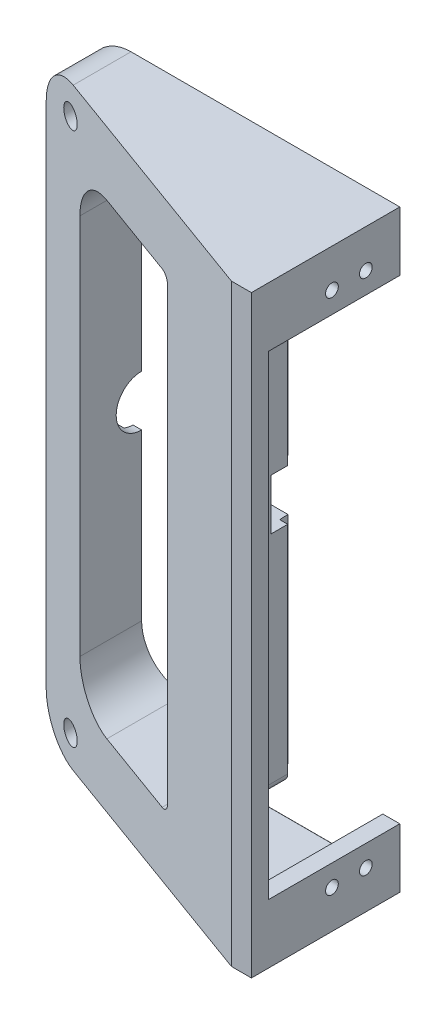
ISO-10303-21;
HEADER;
FILE_DESCRIPTION(('STEP AP214'),'2;1');
FILE_NAME('part.step','',(''),(''),'','','');
FILE_SCHEMA(('AUTOMOTIVE_DESIGN { 1 0 10303 214 1 1 1 1 }'));
ENDSEC;
DATA;
#1=APPLICATION_CONTEXT('core data for automotive mechanical design processes');
#2=APPLICATION_PROTOCOL_DEFINITION('international standard','automotive_design',2000,#1);
#3=PRODUCT_CONTEXT('',#1,'mechanical');
#4=PRODUCT('Part','Part','',(#3));
#5=PRODUCT_RELATED_PRODUCT_CATEGORY('part','',(#4));
#6=PRODUCT_DEFINITION_FORMATION('','',#4);
#7=PRODUCT_DEFINITION_CONTEXT('part definition',#1,'design');
#8=PRODUCT_DEFINITION('design','',#6,#7);
#9=PRODUCT_DEFINITION_SHAPE('','',#8);
#10=(LENGTH_UNIT() NAMED_UNIT(*) SI_UNIT(.MILLI.,.METRE.));
#11=(NAMED_UNIT(*) PLANE_ANGLE_UNIT() SI_UNIT($,.RADIAN.));
#12=(NAMED_UNIT(*) SI_UNIT($,.STERADIAN.) SOLID_ANGLE_UNIT());
#13=UNCERTAINTY_MEASURE_WITH_UNIT(LENGTH_MEASURE(1.E-05),#10,'distance_accuracy_value','');
#14=(GEOMETRIC_REPRESENTATION_CONTEXT(3) GLOBAL_UNCERTAINTY_ASSIGNED_CONTEXT((#13)) GLOBAL_UNIT_ASSIGNED_CONTEXT((#10,
#11,#12)) REPRESENTATION_CONTEXT('',''));
#15=CARTESIAN_POINT('',(0.,0.,0.));
#16=DIRECTION('',(0.,0.,1.));
#17=DIRECTION('',(1.,0.,0.));
#18=AXIS2_PLACEMENT_3D('',#15,#16,#17);
#19=CARTESIAN_POINT('',(-92.5,-60.,0.));
#20=DIRECTION('',(0.,0.,1.));
#21=DIRECTION('',(1.,0.,0.));
#22=AXIS2_PLACEMENT_3D('',#19,#20,#21);
#23=PLANE('',#22);
#24=CARTESIAN_POINT('',(-93.5,63.,0.));
#25=DIRECTION('',(0.,0.,-1.));
#26=DIRECTION('',(-1.,0.,0.));
#27=AXIS2_PLACEMENT_3D('',#24,#25,#26);
#28=CIRCLE('',#27,1.50000000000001);
#29=CARTESIAN_POINT('',(-95.,63.,0.));
#30=VERTEX_POINT('',#29);
#31=EDGE_CURVE('E2069',#30,#30,#28,.T.);
#32=ORIENTED_EDGE('',*,*,#31,.F.);
#33=EDGE_LOOP('',(#32));
#34=FACE_BOUND('',#33,.T.);
#35=CARTESIAN_POINT('',(-93.5,-63.,0.));
#36=DIRECTION('',(0.,0.,1.));
#37=DIRECTION('',(-1.,0.,0.));
#38=AXIS2_PLACEMENT_3D('',#35,#36,#37);
#39=CIRCLE('',#38,1.50000000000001);
#40=CARTESIAN_POINT('',(-95.,-63.,0.));
#41=VERTEX_POINT('',#40);
#42=EDGE_CURVE('E2081',#41,#41,#39,.T.);
#43=ORIENTED_EDGE('',*,*,#42,.T.);
#44=EDGE_LOOP('',(#43));
#45=FACE_BOUND('',#44,.T.);
#46=DIRECTION('',(1.,0.,0.));
#47=VECTOR('',#46,1.);
#48=CARTESIAN_POINT('',(-92.5,-58.8466880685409,0.));
#49=LINE('',#48,#47);
#50=CARTESIAN_POINT('',(-100.5,-58.8466880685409,0.));
#51=VERTEX_POINT('',#50);
#52=CARTESIAN_POINT('',(-98.5,-58.8466880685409,0.));
#53=VERTEX_POINT('',#52);
#54=EDGE_CURVE('E1501',#51,#53,#49,.T.);
#55=ORIENTED_EDGE('',*,*,#54,.T.);
#56=CARTESIAN_POINT('',(-93.5,-63.,0.));
#57=DIRECTION('',(0.,0.,1.));
#58=DIRECTION('',(1.,0.,0.));
#59=AXIS2_PLACEMENT_3D('',#56,#57,#58);
#60=CIRCLE('',#59,6.50000000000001);
#61=CARTESIAN_POINT('',(-87.7337187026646,-66.,0.));
#62=VERTEX_POINT('',#61);
#63=EDGE_CURVE('E1514',#62,#53,#60,.T.);
#64=ORIENTED_EDGE('',*,*,#63,.F.);
#65=DIRECTION('',(0.,1.,0.));
#66=VECTOR('',#65,1.);
#67=CARTESIAN_POINT('',(-87.7337187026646,-60.,0.));
#68=LINE('',#67,#66);
#69=CARTESIAN_POINT('',(-87.7337187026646,-68.,0.));
#70=VERTEX_POINT('',#69);
#71=EDGE_CURVE('E1858',#62,#70,#68,.F.);
#72=ORIENTED_EDGE('',*,*,#71,.T.);
#73=DIRECTION('',(1.,0.,0.));
#74=VECTOR('',#73,1.);
#75=CARTESIAN_POINT('',(-92.5,-68.,0.));
#76=LINE('',#75,#74);
#77=CARTESIAN_POINT('',(-33.1077565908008,-68.,0.));
#78=VERTEX_POINT('',#77);
#79=EDGE_CURVE('E1862',#70,#78,#76,.T.);
#80=ORIENTED_EDGE('',*,*,#79,.T.);
#81=DIRECTION('',(0.,-1.,0.));
#82=VECTOR('',#81,1.);
#83=CARTESIAN_POINT('',(-33.1077565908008,-56.,0.));
#84=LINE('',#83,#82);
#85=CARTESIAN_POINT('',(-33.1077565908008,-56.,0.));
#86=VERTEX_POINT('',#85);
#87=EDGE_CURVE('E1685',#86,#78,#84,.T.);
#88=ORIENTED_EDGE('',*,*,#87,.F.);
#89=DIRECTION('',(1.,0.,0.));
#90=VECTOR('',#89,1.);
#91=CARTESIAN_POINT('',(-33.1077565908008,-56.,0.));
#92=LINE('',#91,#90);
#93=CARTESIAN_POINT('',(-29.1077565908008,-56.,0.));
#94=VERTEX_POINT('',#93);
#95=EDGE_CURVE('E1687',#86,#94,#92,.T.);
#96=ORIENTED_EDGE('',*,*,#95,.T.);
#97=DIRECTION('',(0.,1.,0.));
#98=VECTOR('',#97,1.);
#99=CARTESIAN_POINT('',(-29.1077565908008,-60.,0.));
#100=LINE('',#99,#98);
#101=CARTESIAN_POINT('',(-29.1077565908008,-70.,0.));
#102=VERTEX_POINT('',#101);
#103=EDGE_CURVE('E1725',#102,#94,#100,.T.);
#104=ORIENTED_EDGE('',*,*,#103,.F.);
#105=DIRECTION('',(1.,0.,0.));
#106=VECTOR('',#105,1.);
#107=CARTESIAN_POINT('',(-92.5,-70.,0.));
#108=LINE('',#107,#106);
#109=CARTESIAN_POINT('',(-92.5,-70.,0.));
#110=VERTEX_POINT('',#109);
#111=EDGE_CURVE('E1748',#110,#102,#108,.T.);
#112=ORIENTED_EDGE('',*,*,#111,.F.);
#113=CARTESIAN_POINT('',(-92.5,-60.,0.));
#114=DIRECTION('',(0.,0.,1.));
#115=DIRECTION('',(1.,0.,0.));
#116=AXIS2_PLACEMENT_3D('',#113,#114,#115);
#117=CIRCLE('',#116,10.);
#118=CARTESIAN_POINT('',(-102.5,-60.,0.));
#119=VERTEX_POINT('',#118);
#120=EDGE_CURVE('E1751',#119,#110,#117,.T.);
#121=ORIENTED_EDGE('',*,*,#120,.F.);
#122=DIRECTION('',(0.,-1.,0.));
#123=VECTOR('',#122,1.);
#124=CARTESIAN_POINT('',(-102.5,-60.,0.));
#125=LINE('',#124,#123);
#126=CARTESIAN_POINT('',(-102.5,60.,0.));
#127=VERTEX_POINT('',#126);
#128=EDGE_CURVE('E1745',#127,#119,#125,.T.);
#129=ORIENTED_EDGE('',*,*,#128,.F.);
#130=CARTESIAN_POINT('',(-92.5,60.,0.));
#131=DIRECTION('',(0.,0.,1.));
#132=DIRECTION('',(1.,0.,0.));
#133=AXIS2_PLACEMENT_3D('',#130,#131,#132);
#134=CIRCLE('',#133,10.);
#135=CARTESIAN_POINT('',(-92.5,70.,0.));
#136=VERTEX_POINT('',#135);
#137=EDGE_CURVE('E1749',#136,#127,#134,.T.);
#138=ORIENTED_EDGE('',*,*,#137,.F.);
#139=DIRECTION('',(-1.,0.,0.));
#140=VECTOR('',#139,1.);
#141=CARTESIAN_POINT('',(-92.5,70.,0.));
#142=LINE('',#141,#140);
#143=CARTESIAN_POINT('',(-29.1077565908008,70.,0.));
#144=VERTEX_POINT('',#143);
#145=EDGE_CURVE('E1746',#144,#136,#142,.T.);
#146=ORIENTED_EDGE('',*,*,#145,.F.);
#147=CARTESIAN_POINT('',(-29.1077565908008,56.,0.));
#148=VERTEX_POINT('',#147);
#149=EDGE_CURVE('E1726',#148,#144,#100,.T.);
#150=ORIENTED_EDGE('',*,*,#149,.F.);
#151=DIRECTION('',(1.,0.,0.));
#152=VECTOR('',#151,1.);
#153=CARTESIAN_POINT('',(-33.1077565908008,56.,0.));
#154=LINE('',#153,#152);
#155=CARTESIAN_POINT('',(-33.1077565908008,56.,0.));
#156=VERTEX_POINT('',#155);
#157=EDGE_CURVE('E1682',#156,#148,#154,.T.);
#158=ORIENTED_EDGE('',*,*,#157,.F.);
#159=DIRECTION('',(0.,1.,0.));
#160=VECTOR('',#159,1.);
#161=CARTESIAN_POINT('',(-33.1077565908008,56.,0.));
#162=LINE('',#161,#160);
#163=CARTESIAN_POINT('',(-33.1077565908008,68.,0.));
#164=VERTEX_POINT('',#163);
#165=EDGE_CURVE('E1673',#156,#164,#162,.T.);
#166=ORIENTED_EDGE('',*,*,#165,.T.);
#167=DIRECTION('',(-1.,0.,0.));
#168=VECTOR('',#167,1.);
#169=CARTESIAN_POINT('',(-92.5,68.,0.));
#170=LINE('',#169,#168);
#171=CARTESIAN_POINT('',(-87.7337187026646,68.,0.));
#172=VERTEX_POINT('',#171);
#173=EDGE_CURVE('E1881',#164,#172,#170,.T.);
#174=ORIENTED_EDGE('',*,*,#173,.T.);
#175=DIRECTION('',(0.,-1.,0.));
#176=VECTOR('',#175,1.);
#177=CARTESIAN_POINT('',(-87.7337187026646,-60.,0.));
#178=LINE('',#177,#176);
#179=CARTESIAN_POINT('',(-87.7337187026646,66.,0.));
#180=VERTEX_POINT('',#179);
#181=EDGE_CURVE('E1877',#172,#180,#178,.T.);
#182=ORIENTED_EDGE('',*,*,#181,.T.);
#183=CARTESIAN_POINT('',(-93.5,63.,0.));
#184=DIRECTION('',(0.,0.,1.));
#185=DIRECTION('',(1.,0.,0.));
#186=AXIS2_PLACEMENT_3D('',#183,#184,#185);
#187=CIRCLE('',#186,6.50000000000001);
#188=CARTESIAN_POINT('',(-98.5,58.8466880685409,0.));
#189=VERTEX_POINT('',#188);
#190=EDGE_CURVE('E1527',#180,#189,#187,.F.);
#191=ORIENTED_EDGE('',*,*,#190,.T.);
#192=DIRECTION('',(1.,0.,0.));
#193=VECTOR('',#192,1.);
#194=CARTESIAN_POINT('',(-92.5,58.8466880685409,0.));
#195=LINE('',#194,#193);
#196=CARTESIAN_POINT('',(-100.5,58.8466880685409,0.));
#197=VERTEX_POINT('',#196);
#198=EDGE_CURVE('E1518',#189,#197,#195,.F.);
#199=ORIENTED_EDGE('',*,*,#198,.T.);
#200=DIRECTION('',(0.,-1.,0.));
#201=VECTOR('',#200,1.);
#202=CARTESIAN_POINT('',(-100.5,-60.,0.));
#203=LINE('',#202,#201);
#204=EDGE_CURVE('E1517',#197,#51,#203,.T.);
#205=ORIENTED_EDGE('',*,*,#204,.T.);
#206=EDGE_LOOP('',(#55,#64,#72,#80,#88,#96,#104,#112,#121,#129,#138,#146,#150,#158,#166,#174,
#182,#191,#199,#205));
#207=FACE_BOUND('',#206,.T.);
#208=ADVANCED_FACE('F1060',(#34,#45,#207),#23,.F.);
#209=CARTESIAN_POINT('',(-29.1077565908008,70.,35.01));
#210=DIRECTION('',(1.,0.,0.));
#211=DIRECTION('',(0.,1.,0.));
#212=AXIS2_PLACEMENT_3D('',#209,#210,#211);
#213=PLANE('',#212);
#214=CARTESIAN_POINT('',(-29.1077565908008,61.,8.));
#215=DIRECTION('',(1.,0.,0.));
#216=DIRECTION('',(0.,1.,0.));
#217=AXIS2_PLACEMENT_3D('',#214,#215,#216);
#218=CIRCLE('',#217,1.5);
#219=CARTESIAN_POINT('',(-29.1077565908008,62.5,8.));
#220=VERTEX_POINT('',#219);
#221=EDGE_CURVE('E1732',#220,#220,#218,.F.);
#222=ORIENTED_EDGE('',*,*,#221,.T.);
#223=EDGE_LOOP('',(#222));
#224=FACE_BOUND('',#223,.T.);
#225=CARTESIAN_POINT('',(-29.1077565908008,-61.,16.));
#226=DIRECTION('',(1.,0.,0.));
#227=DIRECTION('',(0.,1.,0.));
#228=AXIS2_PLACEMENT_3D('',#225,#226,#227);
#229=CIRCLE('',#228,1.5);
#230=CARTESIAN_POINT('',(-29.1077565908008,-59.5,16.));
#231=VERTEX_POINT('',#230);
#232=EDGE_CURVE('E1705',#231,#231,#229,.T.);
#233=ORIENTED_EDGE('',*,*,#232,.F.);
#234=EDGE_LOOP('',(#233));
#235=FACE_BOUND('',#234,.T.);
#236=CARTESIAN_POINT('',(-29.1077565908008,-61.,8.));
#237=DIRECTION('',(1.,0.,0.));
#238=DIRECTION('',(0.,1.,0.));
#239=AXIS2_PLACEMENT_3D('',#236,#237,#238);
#240=CIRCLE('',#239,1.5);
#241=CARTESIAN_POINT('',(-29.1077565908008,-59.5,8.));
#242=VERTEX_POINT('',#241);
#243=EDGE_CURVE('E1709',#242,#242,#240,.T.);
#244=ORIENTED_EDGE('',*,*,#243,.F.);
#245=EDGE_LOOP('',(#244));
#246=FACE_BOUND('',#245,.T.);
#247=CARTESIAN_POINT('',(-29.1077565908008,61.,16.));
#248=DIRECTION('',(1.,0.,0.));
#249=DIRECTION('',(0.,1.,0.));
#250=AXIS2_PLACEMENT_3D('',#247,#248,#249);
#251=CIRCLE('',#250,1.5);
#252=CARTESIAN_POINT('',(-29.1077565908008,62.5,16.));
#253=VERTEX_POINT('',#252);
#254=EDGE_CURVE('E1735',#253,#253,#251,.F.);
#255=ORIENTED_EDGE('',*,*,#254,.T.);
#256=EDGE_LOOP('',(#255));
#257=FACE_BOUND('',#256,.T.);
#258=DIRECTION('',(0.,1.,0.));
#259=VECTOR('',#258,1.);
#260=CARTESIAN_POINT('',(-29.1077565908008,-60.,35.));
#261=LINE('',#260,#259);
#262=CARTESIAN_POINT('',(-29.1077565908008,-70.,35.));
#263=VERTEX_POINT('',#262);
#264=CARTESIAN_POINT('',(-29.1077565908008,70.,35.));
#265=VERTEX_POINT('',#264);
#266=EDGE_CURVE('E1716',#263,#265,#261,.T.);
#267=ORIENTED_EDGE('',*,*,#266,.F.);
#268=DIRECTION('',(0.,0.,-1.));
#269=VECTOR('',#268,1.);
#270=CARTESIAN_POINT('',(-29.1077565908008,-70.,35.));
#271=LINE('',#270,#269);
#272=EDGE_CURVE('E1722',#263,#102,#271,.T.);
#273=ORIENTED_EDGE('',*,*,#272,.T.);
#274=ORIENTED_EDGE('',*,*,#103,.T.);
#275=DIRECTION('',(0.,0.,-1.));
#276=VECTOR('',#275,1.);
#277=CARTESIAN_POINT('',(-29.1077565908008,-56.,0.));
#278=LINE('',#277,#276);
#279=CARTESIAN_POINT('',(-29.1077565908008,-56.,31.));
#280=VERTEX_POINT('',#279);
#281=EDGE_CURVE('E1712',#280,#94,#278,.T.);
#282=ORIENTED_EDGE('',*,*,#281,.F.);
#283=DIRECTION('',(0.,1.,0.));
#284=VECTOR('',#283,1.);
#285=CARTESIAN_POINT('',(-29.1077565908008,-60.,31.));
#286=LINE('',#285,#284);
#287=CARTESIAN_POINT('',(-29.1077565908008,56.,31.));
#288=VERTEX_POINT('',#287);
#289=EDGE_CURVE('E1719',#280,#288,#286,.T.);
#290=ORIENTED_EDGE('',*,*,#289,.T.);
#291=DIRECTION('',(0.,0.,1.));
#292=VECTOR('',#291,1.);
#293=CARTESIAN_POINT('',(-29.1077565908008,56.,0.));
#294=LINE('',#293,#292);
#295=EDGE_CURVE('E1714',#148,#288,#294,.T.);
#296=ORIENTED_EDGE('',*,*,#295,.F.);
#297=ORIENTED_EDGE('',*,*,#149,.T.);
#298=DIRECTION('',(0.,0.,1.));
#299=VECTOR('',#298,1.);
#300=CARTESIAN_POINT('',(-29.1077565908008,70.,35.));
#301=LINE('',#300,#299);
#302=EDGE_CURVE('E1729',#144,#265,#301,.T.);
#303=ORIENTED_EDGE('',*,*,#302,.T.);
#304=EDGE_LOOP('',(#267,#273,#274,#282,#290,#296,#297,#303));
#305=FACE_BOUND('',#304,.T.);
#306=ADVANCED_FACE('F2122',(#224,#235,#246,#257,#305),#213,.T.);
#307=CARTESIAN_POINT('',(-61.,-9.99999999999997,10.));
#308=DIRECTION('',(1.,0.,0.));
#309=DIRECTION('',(0.,0.,-1.));
#310=AXIS2_PLACEMENT_3D('',#307,#308,#309);
#311=PLANE('',#310);
#312=CARTESIAN_POINT('',(-61.,0.,0.));
#313=DIRECTION('',(1.,0.,0.));
#314=DIRECTION('',(0.,0.,-1.));
#315=AXIS2_PLACEMENT_3D('',#312,#313,#314);
#316=CIRCLE('',#315,6.);
#317=CARTESIAN_POINT('',(-61.,0.,6.));
#318=VERTEX_POINT('',#317);
#319=CARTESIAN_POINT('',(-61.,5.99999999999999,0.));
#320=VERTEX_POINT('',#319);
#321=EDGE_CURVE('E1629',#318,#320,#316,.F.);
#322=ORIENTED_EDGE('',*,*,#321,.T.);
#323=DIRECTION('',(0.,0.,-1.));
#324=VECTOR('',#323,1.);
#325=CARTESIAN_POINT('',(-61.,5.99999999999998,10.));
#326=LINE('',#325,#324);
#327=CARTESIAN_POINT('',(-61.,5.99999999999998,6.));
#328=VERTEX_POINT('',#327);
#329=EDGE_CURVE('E1562',#328,#320,#326,.T.);
#330=ORIENTED_EDGE('',*,*,#329,.F.);
#331=DIRECTION('',(0.,-1.,0.));
#332=VECTOR('',#331,1.);
#333=CARTESIAN_POINT('',(-61.,-9.99999999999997,6.));
#334=LINE('',#333,#332);
#335=EDGE_CURVE('E1555',#328,#318,#334,.T.);
#336=ORIENTED_EDGE('',*,*,#335,.T.);
#337=EDGE_LOOP('',(#322,#330,#336));
#338=FACE_BOUND('',#337,.T.);
#339=ADVANCED_FACE('F2127',(#338),#311,.T.);
#340=DIRECTION('',(0.,0.,-1.));
#341=VECTOR('',#340,1.);
#342=CARTESIAN_POINT('',(-61.,-5.99999999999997,10.));
#343=LINE('',#342,#341);
#344=CARTESIAN_POINT('',(-61.,-5.99999999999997,6.));
#345=VERTEX_POINT('',#344);
#346=CARTESIAN_POINT('',(-61.,-6.00000000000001,0.));
#347=VERTEX_POINT('',#346);
#348=EDGE_CURVE('E1560',#345,#347,#343,.T.);
#349=ORIENTED_EDGE('',*,*,#348,.T.);
#350=EDGE_CURVE('E1630',#347,#318,#316,.F.);
#351=ORIENTED_EDGE('',*,*,#350,.T.);
#352=EDGE_CURVE('E1559',#318,#345,#334,.T.);
#353=ORIENTED_EDGE('',*,*,#352,.T.);
#354=EDGE_LOOP('',(#349,#351,#353));
#355=FACE_BOUND('',#354,.T.);
#356=ADVANCED_FACE('F2147',(#355),#311,.T.);
#357=CARTESIAN_POINT('',(-59.,-11.5,-0.00100000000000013));
#358=DIRECTION('',(0.,0.,1.));
#359=DIRECTION('',(1.,0.,0.));
#360=AXIS2_PLACEMENT_3D('',#357,#358,#359);
#361=CYLINDRICAL_SURFACE('',#360,0.999999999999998);
#362=CARTESIAN_POINT('',(-59.,-11.5,2.));
#363=DIRECTION('',(0.,0.,-1.));
#364=DIRECTION('',(1.,0.,0.));
#365=AXIS2_PLACEMENT_3D('',#362,#363,#364);
#366=CIRCLE('',#365,0.999999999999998);
#367=CARTESIAN_POINT('',(-58.,-11.5,2.));
#368=VERTEX_POINT('',#367);
#369=EDGE_CURVE('E1667',#368,#368,#366,.T.);
#370=ORIENTED_EDGE('',*,*,#369,.F.);
#371=EDGE_LOOP('',(#370));
#372=FACE_BOUND('',#371,.T.);
#373=CARTESIAN_POINT('',(-59.,-11.5,0.));
#374=DIRECTION('',(0.,0.,1.));
#375=DIRECTION('',(1.,0.,0.));
#376=AXIS2_PLACEMENT_3D('',#373,#374,#375);
#377=CIRCLE('',#376,0.999999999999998);
#378=CARTESIAN_POINT('',(-58.,-11.5,0.));
#379=VERTEX_POINT('',#378);
#380=EDGE_CURVE('E1670',#379,#379,#377,.T.);
#381=ORIENTED_EDGE('',*,*,#380,.F.);
#382=EDGE_LOOP('',(#381));
#383=FACE_BOUND('',#382,.T.);
#384=ADVANCED_FACE('F2153',(#372,#383),#361,.F.);
#385=CARTESIAN_POINT('',(-65.,-9.99999999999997,10.));
#386=DIRECTION('',(1.,0.,0.));
#387=DIRECTION('',(0.,0.,-1.));
#388=AXIS2_PLACEMENT_3D('',#385,#386,#387);
#389=PLANE('',#388);
#390=DIRECTION('',(0.,0.,-1.));
#391=VECTOR('',#390,1.);
#392=CARTESIAN_POINT('',(-65.,9.99999999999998,10.));
#393=LINE('',#392,#391);
#394=CARTESIAN_POINT('',(-65.,9.99999999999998,10.));
#395=VERTEX_POINT('',#394);
#396=CARTESIAN_POINT('',(-65.,9.99999999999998,2.));
#397=VERTEX_POINT('',#396);
#398=EDGE_CURVE('E2084',#395,#397,#393,.T.);
#399=ORIENTED_EDGE('',*,*,#398,.T.);
#400=DIRECTION('',(0.,0.,1.));
#401=VECTOR('',#400,1.);
#402=CARTESIAN_POINT('',(-65.,9.99999999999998,10.));
#403=LINE('',#402,#401);
#404=CARTESIAN_POINT('',(-65.,9.99999999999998,0.));
#405=VERTEX_POINT('',#404);
#406=EDGE_CURVE('E1636',#405,#397,#403,.T.);
#407=ORIENTED_EDGE('',*,*,#406,.F.);
#408=DIRECTION('',(0.,-1.,0.));
#409=VECTOR('',#408,1.);
#410=CARTESIAN_POINT('',(-65.,-9.99999999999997,0.));
#411=LINE('',#410,#409);
#412=CARTESIAN_POINT('',(-65.,5.99999999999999,0.));
#413=VERTEX_POINT('',#412);
#414=EDGE_CURVE('E1532',#405,#413,#411,.T.);
#415=ORIENTED_EDGE('',*,*,#414,.T.);
#416=CARTESIAN_POINT('',(-65.,0.,0.));
#417=DIRECTION('',(1.,0.,0.));
#418=DIRECTION('',(0.,0.,-1.));
#419=AXIS2_PLACEMENT_3D('',#416,#417,#418);
#420=CIRCLE('',#419,6.);
#421=CARTESIAN_POINT('',(-65.,-6.00000000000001,0.));
#422=VERTEX_POINT('',#421);
#423=EDGE_CURVE('E1619',#413,#422,#420,.T.);
#424=ORIENTED_EDGE('',*,*,#423,.T.);
#425=CARTESIAN_POINT('',(-65.,-9.99999999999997,0.));
#426=VERTEX_POINT('',#425);
#427=EDGE_CURVE('E1528',#422,#426,#411,.T.);
#428=ORIENTED_EDGE('',*,*,#427,.T.);
#429=DIRECTION('',(0.,0.,-1.));
#430=VECTOR('',#429,1.);
#431=CARTESIAN_POINT('',(-65.,-9.99999999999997,10.));
#432=LINE('',#431,#430);
#433=CARTESIAN_POINT('',(-65.,-9.99999999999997,2.));
#434=VERTEX_POINT('',#433);
#435=EDGE_CURVE('E1657',#426,#434,#432,.F.);
#436=ORIENTED_EDGE('',*,*,#435,.T.);
#437=DIRECTION('',(0.,0.,-1.));
#438=VECTOR('',#437,1.);
#439=CARTESIAN_POINT('',(-65.,-9.99999999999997,10.));
#440=LINE('',#439,#438);
#441=CARTESIAN_POINT('',(-65.,-9.99999999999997,10.));
#442=VERTEX_POINT('',#441);
#443=EDGE_CURVE('E2089',#442,#434,#440,.T.);
#444=ORIENTED_EDGE('',*,*,#443,.F.);
#445=DIRECTION('',(0.,-1.,0.));
#446=VECTOR('',#445,1.);
#447=CARTESIAN_POINT('',(-65.,-9.99999999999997,10.));
#448=LINE('',#447,#446);
#449=EDGE_CURVE('E2095',#395,#442,#448,.T.);
#450=ORIENTED_EDGE('',*,*,#449,.F.);
#451=EDGE_LOOP('',(#399,#407,#415,#424,#428,#436,#444,#450));
#452=FACE_BOUND('',#451,.T.);
#453=ADVANCED_FACE('F2104',(#452),#389,.F.);
#454=CARTESIAN_POINT('',(-47.5835921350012,0.,0.));
#455=DIRECTION('',(-1.,0.,0.));
#456=DIRECTION('',(0.,-1.,0.));
#457=AXIS2_PLACEMENT_3D('',#454,#455,#456);
#458=CYLINDRICAL_SURFACE('',#457,6.);
#459=DIRECTION('',(-1.,0.,0.));
#460=VECTOR('',#459,1.);
#461=CARTESIAN_POINT('',(-47.5835921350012,-6.00000000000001,0.));
#462=LINE('',#461,#460);
#463=EDGE_CURVE('E1625',#347,#422,#462,.T.);
#464=ORIENTED_EDGE('',*,*,#463,.T.);
#465=ORIENTED_EDGE('',*,*,#423,.F.);
#466=DIRECTION('',(-1.,0.,0.));
#467=VECTOR('',#466,1.);
#468=CARTESIAN_POINT('',(-47.5835921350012,5.99999999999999,0.));
#469=LINE('',#468,#467);
#470=EDGE_CURVE('E1621',#320,#413,#469,.T.);
#471=ORIENTED_EDGE('',*,*,#470,.F.);
#472=ORIENTED_EDGE('',*,*,#321,.F.);
#473=ORIENTED_EDGE('',*,*,#350,.F.);
#474=EDGE_LOOP('',(#464,#465,#471,#472,#473));
#475=FACE_BOUND('',#474,.T.);
#476=ADVANCED_FACE('F2212',(#475),#458,.F.);
#477=CARTESIAN_POINT('',(-59.,11.5,-0.00100000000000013));
#478=DIRECTION('',(0.,0.,1.));
#479=DIRECTION('',(1.,0.,0.));
#480=AXIS2_PLACEMENT_3D('',#477,#478,#479);
#481=CYLINDRICAL_SURFACE('',#480,0.999999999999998);
#482=CARTESIAN_POINT('',(-59.,11.5,2.));
#483=DIRECTION('',(0.,0.,1.));
#484=DIRECTION('',(1.,0.,0.));
#485=AXIS2_PLACEMENT_3D('',#482,#483,#484);
#486=CIRCLE('',#485,0.999999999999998);
#487=CARTESIAN_POINT('',(-58.,11.5,2.));
#488=VERTEX_POINT('',#487);
#489=EDGE_CURVE('E1651',#488,#488,#486,.T.);
#490=ORIENTED_EDGE('',*,*,#489,.T.);
#491=EDGE_LOOP('',(#490));
#492=FACE_BOUND('',#491,.T.);
#493=CARTESIAN_POINT('',(-59.,11.5,0.));
#494=DIRECTION('',(0.,0.,1.));
#495=DIRECTION('',(1.,0.,0.));
#496=AXIS2_PLACEMENT_3D('',#493,#494,#495);
#497=CIRCLE('',#496,0.999999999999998);
#498=CARTESIAN_POINT('',(-58.,11.5,0.));
#499=VERTEX_POINT('',#498);
#500=EDGE_CURVE('E1646',#499,#499,#497,.F.);
#501=ORIENTED_EDGE('',*,*,#500,.T.);
#502=EDGE_LOOP('',(#501));
#503=FACE_BOUND('',#502,.T.);
#504=ADVANCED_FACE('F2164',(#492,#503),#481,.F.);
#505=CARTESIAN_POINT('',(-57.5,5.99999999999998,10.));
#506=DIRECTION('',(0.,-1.,0.));
#507=DIRECTION('',(1.,0.,0.));
#508=AXIS2_PLACEMENT_3D('',#505,#506,#507);
#509=PLANE('',#508);
#510=DIRECTION('',(-0.0523359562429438,0.,-0.998629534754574));
#511=VECTOR('',#510,1.);
#512=CARTESIAN_POINT('',(-54.9828357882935,5.99999999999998,9.86808101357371));
#513=LINE('',#512,#511);
#514=CARTESIAN_POINT('',(-55.3935073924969,5.99999999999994,2.032));
#515=VERTEX_POINT('',#514);
#516=CARTESIAN_POINT('',(-55.5,5.99999999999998,0.));
#517=VERTEX_POINT('',#516);
#518=EDGE_CURVE('E1738',#515,#517,#513,.T.);
#519=ORIENTED_EDGE('',*,*,#518,.F.);
#520=DIRECTION('',(-1.,0.,0.));
#521=VECTOR('',#520,1.);
#522=CARTESIAN_POINT('',(-57.5,5.99999999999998,2.032));
#523=LINE('',#522,#521);
#524=CARTESIAN_POINT('',(-53.5,5.99999999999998,2.032));
#525=VERTEX_POINT('',#524);
#526=EDGE_CURVE('E1986',#525,#515,#523,.T.);
#527=ORIENTED_EDGE('',*,*,#526,.F.);
#528=DIRECTION('',(0.,0.,-1.));
#529=VECTOR('',#528,1.);
#530=CARTESIAN_POINT('',(-53.5,5.99999999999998,10.));
#531=LINE('',#530,#529);
#532=CARTESIAN_POINT('',(-53.5,5.99999999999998,6.));
#533=VERTEX_POINT('',#532);
#534=EDGE_CURVE('E1567',#533,#525,#531,.T.);
#535=ORIENTED_EDGE('',*,*,#534,.F.);
#536=DIRECTION('',(-1.,0.,0.));
#537=VECTOR('',#536,1.);
#538=CARTESIAN_POINT('',(-57.5,5.99999999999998,6.));
#539=LINE('',#538,#537);
#540=EDGE_CURVE('E1563',#533,#328,#539,.T.);
#541=ORIENTED_EDGE('',*,*,#540,.T.);
#542=ORIENTED_EDGE('',*,*,#329,.T.);
#543=DIRECTION('',(-1.,0.,0.));
#544=VECTOR('',#543,1.);
#545=CARTESIAN_POINT('',(-57.5,5.99999999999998,0.));
#546=LINE('',#545,#544);
#547=EDGE_CURVE('E1546',#517,#320,#546,.T.);
#548=ORIENTED_EDGE('',*,*,#547,.F.);
#549=EDGE_LOOP('',(#519,#527,#535,#541,#542,#548));
#550=FACE_BOUND('',#549,.T.);
#551=ADVANCED_FACE('F2160',(#550),#509,.T.);
#552=CARTESIAN_POINT('',(0.,0.,6.));
#553=DIRECTION('',(0.,0.,1.));
#554=DIRECTION('',(1.,0.,0.));
#555=AXIS2_PLACEMENT_3D('',#552,#553,#554);
#556=PLANE('',#555);
#557=DIRECTION('',(0.,1.,0.));
#558=VECTOR('',#557,1.);
#559=CARTESIAN_POINT('',(-53.5,55.,6.));
#560=LINE('',#559,#558);
#561=CARTESIAN_POINT('',(-53.5,-5.99999999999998,6.));
#562=VERTEX_POINT('',#561);
#563=EDGE_CURVE('E1552',#562,#533,#560,.T.);
#564=ORIENTED_EDGE('',*,*,#563,.F.);
#565=DIRECTION('',(1.,0.,0.));
#566=VECTOR('',#565,1.);
#567=CARTESIAN_POINT('',(-57.5,-5.99999999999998,6.));
#568=LINE('',#567,#566);
#569=EDGE_CURVE('E1553',#345,#562,#568,.T.);
#570=ORIENTED_EDGE('',*,*,#569,.F.);
#571=ORIENTED_EDGE('',*,*,#352,.F.);
#572=ORIENTED_EDGE('',*,*,#335,.F.);
#573=ORIENTED_EDGE('',*,*,#540,.F.);
#574=EDGE_LOOP('',(#564,#570,#571,#572,#573));
#575=FACE_BOUND('',#574,.T.);
#576=ADVANCED_FACE('F2163',(#575),#556,.F.);
#577=CARTESIAN_POINT('',(-57.5,-5.99999999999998,10.));
#578=DIRECTION('',(0.,1.,0.));
#579=DIRECTION('',(-1.,0.,0.));
#580=AXIS2_PLACEMENT_3D('',#577,#578,#579);
#581=PLANE('',#580);
#582=DIRECTION('',(0.0523359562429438,0.,0.998629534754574));
#583=VECTOR('',#582,1.);
#584=CARTESIAN_POINT('',(-54.9828357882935,-5.99999999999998,9.86808101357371));
#585=LINE('',#584,#583);
#586=CARTESIAN_POINT('',(-55.5,-5.99999999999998,0.));
#587=VERTEX_POINT('',#586);
#588=CARTESIAN_POINT('',(-55.3935073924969,-5.99999999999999,2.032));
#589=VERTEX_POINT('',#588);
#590=EDGE_CURVE('E1944',#587,#589,#585,.T.);
#591=ORIENTED_EDGE('',*,*,#590,.F.);
#592=DIRECTION('',(1.,0.,0.));
#593=VECTOR('',#592,1.);
#594=CARTESIAN_POINT('',(-57.5,-5.99999999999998,0.));
#595=LINE('',#594,#593);
#596=EDGE_CURVE('E1549',#347,#587,#595,.T.);
#597=ORIENTED_EDGE('',*,*,#596,.F.);
#598=ORIENTED_EDGE('',*,*,#348,.F.);
#599=ORIENTED_EDGE('',*,*,#569,.T.);
#600=DIRECTION('',(0.,0.,-1.));
#601=VECTOR('',#600,1.);
#602=CARTESIAN_POINT('',(-53.5,-5.99999999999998,35.));
#603=LINE('',#602,#601);
#604=CARTESIAN_POINT('',(-53.5,-5.99999999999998,2.032));
#605=VERTEX_POINT('',#604);
#606=EDGE_CURVE('E1556',#562,#605,#603,.T.);
#607=ORIENTED_EDGE('',*,*,#606,.T.);
#608=DIRECTION('',(1.,0.,0.));
#609=VECTOR('',#608,1.);
#610=CARTESIAN_POINT('',(-57.5,-5.99999999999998,2.032));
#611=LINE('',#610,#609);
#612=EDGE_CURVE('E1938',#589,#605,#611,.T.);
#613=ORIENTED_EDGE('',*,*,#612,.F.);
#614=EDGE_LOOP('',(#591,#597,#598,#599,#607,#613));
#615=FACE_BOUND('',#614,.T.);
#616=ADVANCED_FACE('F2158',(#615),#581,.T.);
#617=CARTESIAN_POINT('',(-90.,-6.00000000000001,0.));
#618=VERTEX_POINT('',#617);
#619=CARTESIAN_POINT('',(-92.,-5.99999999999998,0.));
#620=VERTEX_POINT('',#619);
#621=EDGE_CURVE('E1628',#618,#620,#462,.T.);
#622=ORIENTED_EDGE('',*,*,#621,.T.);
#623=CARTESIAN_POINT('',(-92.,0.,0.));
#624=DIRECTION('',(0.998629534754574,0.,0.0523359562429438));
#625=DIRECTION('',(-0.0523359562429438,0.,0.998629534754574));
#626=AXIS2_PLACEMENT_3D('',#623,#624,#625);
#627=ELLIPSE('',#626,6.00823407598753,6.);
#628=CARTESIAN_POINT('',(-92.1064926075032,-5.64543851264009,2.032));
#629=VERTEX_POINT('',#628);
#630=EDGE_CURVE('E1941',#620,#629,#627,.F.);
#631=ORIENTED_EDGE('',*,*,#630,.T.);
#632=DIRECTION('',(-1.,0.,0.));
#633=VECTOR('',#632,1.);
#634=CARTESIAN_POINT('',(-47.5835921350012,-5.64543851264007,2.032));
#635=LINE('',#634,#633);
#636=CARTESIAN_POINT('',(-94.,-5.64543851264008,2.032));
#637=VERTEX_POINT('',#636);
#638=EDGE_CURVE('E1935',#629,#637,#635,.T.);
#639=ORIENTED_EDGE('',*,*,#638,.T.);
#640=CARTESIAN_POINT('',(-94.,0.,0.));
#641=DIRECTION('',(-1.,0.,0.));
#642=DIRECTION('',(0.,-1.,0.));
#643=AXIS2_PLACEMENT_3D('',#640,#641,#642);
#644=CIRCLE('',#643,6.);
#645=CARTESIAN_POINT('',(-94.,5.64543851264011,2.032));
#646=VERTEX_POINT('',#645);
#647=EDGE_CURVE('E1632',#637,#646,#644,.T.);
#648=ORIENTED_EDGE('',*,*,#647,.T.);
#649=DIRECTION('',(-1.,0.,0.));
#650=VECTOR('',#649,1.);
#651=CARTESIAN_POINT('',(-47.5835921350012,5.64543851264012,2.032));
#652=LINE('',#651,#650);
#653=CARTESIAN_POINT('',(-92.1064926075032,5.64543851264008,2.032));
#654=VERTEX_POINT('',#653);
#655=EDGE_CURVE('E1983',#646,#654,#652,.F.);
#656=ORIENTED_EDGE('',*,*,#655,.T.);
#657=CARTESIAN_POINT('',(-92.,0.,0.));
#658=DIRECTION('',(0.998629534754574,0.,0.0523359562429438));
#659=DIRECTION('',(-0.0523359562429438,0.,0.998629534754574));
#660=AXIS2_PLACEMENT_3D('',#657,#658,#659);
#661=ELLIPSE('',#660,6.00823407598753,6.);
#662=CARTESIAN_POINT('',(-92.,5.99999999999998,0.));
#663=VERTEX_POINT('',#662);
#664=EDGE_CURVE('E1988',#654,#663,#661,.F.);
#665=ORIENTED_EDGE('',*,*,#664,.T.);
#666=CARTESIAN_POINT('',(-90.,5.99999999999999,0.));
#667=VERTEX_POINT('',#666);
#668=EDGE_CURVE('E1624',#667,#663,#469,.T.);
#669=ORIENTED_EDGE('',*,*,#668,.F.);
#670=CARTESIAN_POINT('',(-90.,0.,0.));
#671=DIRECTION('',(1.,0.,0.));
#672=DIRECTION('',(0.,1.,0.));
#673=AXIS2_PLACEMENT_3D('',#670,#671,#672);
#674=CIRCLE('',#673,6.);
#675=EDGE_CURVE('E1548',#667,#618,#674,.T.);
#676=ORIENTED_EDGE('',*,*,#675,.T.);
#677=EDGE_LOOP('',(#622,#631,#639,#648,#656,#665,#669,#676));
#678=FACE_BOUND('',#677,.T.);
#679=ADVANCED_FACE('F2207',(#678),#458,.F.);
#680=CARTESIAN_POINT('',(8.74999999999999,0.,2.));
#681=DIRECTION('',(0.,0.,1.));
#682=DIRECTION('',(1.,0.,0.));
#683=AXIS2_PLACEMENT_3D('',#680,#681,#682);
#684=PLANE('',#683);
#685=ORIENTED_EDGE('',*,*,#369,.T.);
#686=EDGE_LOOP('',(#685));
#687=FACE_BOUND('',#686,.T.);
#688=DIRECTION('',(0.,1.,0.));
#689=VECTOR('',#688,1.);
#690=CARTESIAN_POINT('',(-57.5,55.,2.));
#691=LINE('',#690,#689);
#692=CARTESIAN_POINT('',(-57.5,-17.4999999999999,2.));
#693=VERTEX_POINT('',#692);
#694=CARTESIAN_POINT('',(-57.5,-12.,2.));
#695=VERTEX_POINT('',#694);
#696=EDGE_CURVE('E1659',#693,#695,#691,.T.);
#697=ORIENTED_EDGE('',*,*,#696,.T.);
#698=CARTESIAN_POINT('',(-59.5,-12.,2.));
#699=DIRECTION('',(0.,0.,1.));
#700=DIRECTION('',(1.,0.,0.));
#701=AXIS2_PLACEMENT_3D('',#698,#699,#700);
#702=CIRCLE('',#701,2.);
#703=CARTESIAN_POINT('',(-59.5,-9.99999999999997,2.));
#704=VERTEX_POINT('',#703);
#705=EDGE_CURVE('E1084',#695,#704,#702,.T.);
#706=ORIENTED_EDGE('',*,*,#705,.T.);
#707=DIRECTION('',(1.,0.,0.));
#708=VECTOR('',#707,1.);
#709=CARTESIAN_POINT('',(-57.5,-9.99999999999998,2.));
#710=LINE('',#709,#708);
#711=EDGE_CURVE('E1660',#434,#704,#710,.T.);
#712=ORIENTED_EDGE('',*,*,#711,.F.);
#713=DIRECTION('',(-0.707106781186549,0.707106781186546,0.));
#714=VECTOR('',#713,1.);
#715=CARTESIAN_POINT('',(-57.5,-17.4999999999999,2.));
#716=LINE('',#715,#714);
#717=EDGE_CURVE('E1662',#693,#434,#716,.T.);
#718=ORIENTED_EDGE('',*,*,#717,.F.);
#719=EDGE_LOOP('',(#697,#706,#712,#718));
#720=FACE_BOUND('',#719,.T.);
#721=ADVANCED_FACE('F2210',(#687,#720),#684,.T.);
#722=CARTESIAN_POINT('',(-57.5,-9.99999999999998,10.));
#723=DIRECTION('',(0.,1.,0.));
#724=DIRECTION('',(-1.,0.,0.));
#725=AXIS2_PLACEMENT_3D('',#722,#723,#724);
#726=PLANE('',#725);
#727=ORIENTED_EDGE('',*,*,#711,.T.);
#728=DIRECTION('',(0.,0.,-1.));
#729=VECTOR('',#728,1.);
#730=CARTESIAN_POINT('',(-59.5,-9.99999999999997,10.));
#731=LINE('',#730,#729);
#732=CARTESIAN_POINT('',(-59.5,-9.99999999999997,10.));
#733=VERTEX_POINT('',#732);
#734=EDGE_CURVE('E1828',#704,#733,#731,.F.);
#735=ORIENTED_EDGE('',*,*,#734,.T.);
#736=DIRECTION('',(1.,0.,0.));
#737=VECTOR('',#736,1.);
#738=CARTESIAN_POINT('',(-57.5,-9.99999999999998,10.));
#739=LINE('',#738,#737);
#740=EDGE_CURVE('E2091',#442,#733,#739,.T.);
#741=ORIENTED_EDGE('',*,*,#740,.F.);
#742=ORIENTED_EDGE('',*,*,#443,.T.);
#743=EDGE_LOOP('',(#727,#735,#741,#742));
#744=FACE_BOUND('',#743,.T.);
#745=ADVANCED_FACE('F2108',(#744),#726,.F.);
#746=CARTESIAN_POINT('',(0.,0.,10.));
#747=DIRECTION('',(0.,0.,1.));
#748=DIRECTION('',(1.,0.,0.));
#749=AXIS2_PLACEMENT_3D('',#746,#747,#748);
#750=PLANE('',#749);
#751=ORIENTED_EDGE('',*,*,#740,.T.);
#752=DIRECTION('',(0.,1.,0.));
#753=VECTOR('',#752,1.);
#754=CARTESIAN_POINT('',(-59.5,9.99999999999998,10.));
#755=LINE('',#754,#753);
#756=CARTESIAN_POINT('',(-59.5,9.99999999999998,10.));
#757=VERTEX_POINT('',#756);
#758=EDGE_CURVE('E1818',#733,#757,#755,.T.);
#759=ORIENTED_EDGE('',*,*,#758,.T.);
#760=DIRECTION('',(-1.,0.,0.));
#761=VECTOR('',#760,1.);
#762=CARTESIAN_POINT('',(-57.5,9.99999999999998,10.));
#763=LINE('',#762,#761);
#764=EDGE_CURVE('E1535',#757,#395,#763,.T.);
#765=ORIENTED_EDGE('',*,*,#764,.T.);
#766=ORIENTED_EDGE('',*,*,#449,.T.);
#767=EDGE_LOOP('',(#751,#759,#765,#766));
#768=FACE_BOUND('',#767,.T.);
#769=ADVANCED_FACE('F2100',(#768),#750,.T.);
#770=CARTESIAN_POINT('',(-57.5,9.99999999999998,10.));
#771=DIRECTION('',(0.,-1.,0.));
#772=DIRECTION('',(1.,0.,0.));
#773=AXIS2_PLACEMENT_3D('',#770,#771,#772);
#774=PLANE('',#773);
#775=ORIENTED_EDGE('',*,*,#764,.F.);
#776=DIRECTION('',(0.,0.,-1.));
#777=VECTOR('',#776,1.);
#778=CARTESIAN_POINT('',(-59.5,9.99999999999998,10.));
#779=LINE('',#778,#777);
#780=CARTESIAN_POINT('',(-59.5,9.99999999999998,2.));
#781=VERTEX_POINT('',#780);
#782=EDGE_CURVE('E1069',#757,#781,#779,.T.);
#783=ORIENTED_EDGE('',*,*,#782,.T.);
#784=DIRECTION('',(-1.,0.,0.));
#785=VECTOR('',#784,1.);
#786=CARTESIAN_POINT('',(-57.5,9.99999999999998,2.));
#787=LINE('',#786,#785);
#788=EDGE_CURVE('E1640',#781,#397,#787,.T.);
#789=ORIENTED_EDGE('',*,*,#788,.T.);
#790=ORIENTED_EDGE('',*,*,#398,.F.);
#791=EDGE_LOOP('',(#775,#783,#789,#790));
#792=FACE_BOUND('',#791,.T.);
#793=ADVANCED_FACE('F2101',(#792),#774,.F.);
#794=CARTESIAN_POINT('',(8.74999999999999,0.,2.));
#795=DIRECTION('',(0.,0.,1.));
#796=DIRECTION('',(1.,0.,0.));
#797=AXIS2_PLACEMENT_3D('',#794,#795,#796);
#798=PLANE('',#797);
#799=ORIENTED_EDGE('',*,*,#489,.F.);
#800=EDGE_LOOP('',(#799));
#801=FACE_BOUND('',#800,.T.);
#802=ORIENTED_EDGE('',*,*,#788,.F.);
#803=CARTESIAN_POINT('',(-59.5,12.,2.));
#804=DIRECTION('',(0.,0.,1.));
#805=DIRECTION('',(1.,0.,0.));
#806=AXIS2_PLACEMENT_3D('',#803,#804,#805);
#807=CIRCLE('',#806,2.);
#808=CARTESIAN_POINT('',(-57.5,12.,2.));
#809=VERTEX_POINT('',#808);
#810=EDGE_CURVE('E14',#781,#809,#807,.T.);
#811=ORIENTED_EDGE('',*,*,#810,.T.);
#812=DIRECTION('',(0.,1.,0.));
#813=VECTOR('',#812,1.);
#814=CARTESIAN_POINT('',(-57.5,55.,2.));
#815=LINE('',#814,#813);
#816=CARTESIAN_POINT('',(-57.5,17.4999999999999,2.));
#817=VERTEX_POINT('',#816);
#818=EDGE_CURVE('E1639',#809,#817,#815,.T.);
#819=ORIENTED_EDGE('',*,*,#818,.T.);
#820=DIRECTION('',(-0.707106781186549,-0.707106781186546,0.));
#821=VECTOR('',#820,1.);
#822=CARTESIAN_POINT('',(-57.5,17.4999999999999,2.));
#823=LINE('',#822,#821);
#824=EDGE_CURVE('E1642',#817,#397,#823,.T.);
#825=ORIENTED_EDGE('',*,*,#824,.T.);
#826=EDGE_LOOP('',(#802,#811,#819,#825));
#827=FACE_BOUND('',#826,.T.);
#828=ADVANCED_FACE('F2215',(#801,#827),#798,.T.);
#829=CARTESIAN_POINT('',(-57.5,17.4999999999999,0.));
#830=DIRECTION('',(-0.707106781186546,0.707106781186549,0.));
#831=DIRECTION('',(-0.707106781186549,-0.707106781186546,0.));
#832=AXIS2_PLACEMENT_3D('',#829,#830,#831);
#833=PLANE('',#832);
#834=ORIENTED_EDGE('',*,*,#824,.F.);
#835=DIRECTION('',(0.,0.,-1.));
#836=VECTOR('',#835,1.);
#837=CARTESIAN_POINT('',(-57.5,17.4999999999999,35.));
#838=LINE('',#837,#836);
#839=CARTESIAN_POINT('',(-57.5,17.4999999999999,0.));
#840=VERTEX_POINT('',#839);
#841=EDGE_CURVE('E1634',#817,#840,#838,.T.);
#842=ORIENTED_EDGE('',*,*,#841,.T.);
#843=DIRECTION('',(-0.707106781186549,-0.707106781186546,0.));
#844=VECTOR('',#843,1.);
#845=CARTESIAN_POINT('',(-57.5,17.4999999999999,0.));
#846=LINE('',#845,#844);
#847=EDGE_CURVE('E1644',#840,#405,#846,.T.);
#848=ORIENTED_EDGE('',*,*,#847,.T.);
#849=ORIENTED_EDGE('',*,*,#406,.T.);
#850=EDGE_LOOP('',(#834,#842,#848,#849));
#851=FACE_BOUND('',#850,.T.);
#852=ADVANCED_FACE('F2141',(#851),#833,.T.);
#853=ORIENTED_EDGE('',*,*,#596,.T.);
#854=DIRECTION('',(0.,1.,0.));
#855=VECTOR('',#854,1.);
#856=CARTESIAN_POINT('',(-55.5,-60.,0.));
#857=LINE('',#856,#855);
#858=CARTESIAN_POINT('',(-55.5,-57.,0.));
#859=VERTEX_POINT('',#858);
#860=EDGE_CURVE('E1907',#859,#587,#857,.T.);
#861=ORIENTED_EDGE('',*,*,#860,.F.);
#862=DIRECTION('',(1.,0.,0.));
#863=VECTOR('',#862,1.);
#864=CARTESIAN_POINT('',(-92.5,-57.,0.));
#865=LINE('',#864,#863);
#866=CARTESIAN_POINT('',(-80.,-57.,0.));
#867=VERTEX_POINT('',#866);
#868=EDGE_CURVE('E1904',#867,#859,#865,.T.);
#869=ORIENTED_EDGE('',*,*,#868,.F.);
#870=CARTESIAN_POINT('',(-80.,-45.,0.));
#871=DIRECTION('',(0.,0.,1.));
#872=DIRECTION('',(1.,0.,0.));
#873=AXIS2_PLACEMENT_3D('',#870,#871,#872);
#874=CIRCLE('',#873,12.);
#875=CARTESIAN_POINT('',(-92.,-45.,0.));
#876=VERTEX_POINT('',#875);
#877=EDGE_CURVE('E1901',#876,#867,#874,.T.);
#878=ORIENTED_EDGE('',*,*,#877,.F.);
#879=DIRECTION('',(0.,-1.,0.));
#880=VECTOR('',#879,1.);
#881=CARTESIAN_POINT('',(-92.,-60.,0.));
#882=LINE('',#881,#880);
#883=EDGE_CURVE('E1888',#620,#876,#882,.T.);
#884=ORIENTED_EDGE('',*,*,#883,.F.);
#885=ORIENTED_EDGE('',*,*,#621,.F.);
#886=DIRECTION('',(0.,-1.,0.));
#887=VECTOR('',#886,1.);
#888=CARTESIAN_POINT('',(-90.,45.,0.));
#889=LINE('',#888,#887);
#890=CARTESIAN_POINT('',(-90.,-45.,0.));
#891=VERTEX_POINT('',#890);
#892=EDGE_CURVE('E2031',#618,#891,#889,.T.);
#893=ORIENTED_EDGE('',*,*,#892,.T.);
#894=CARTESIAN_POINT('',(-80.,-45.,0.));
#895=DIRECTION('',(0.,0.,1.));
#896=DIRECTION('',(1.,0.,0.));
#897=AXIS2_PLACEMENT_3D('',#894,#895,#896);
#898=CIRCLE('',#897,9.99999999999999);
#899=CARTESIAN_POINT('',(-80.,-55.,0.));
#900=VERTEX_POINT('',#899);
#901=EDGE_CURVE('E2026',#891,#900,#898,.T.);
#902=ORIENTED_EDGE('',*,*,#901,.T.);
#903=DIRECTION('',(1.,0.,0.));
#904=VECTOR('',#903,1.);
#905=CARTESIAN_POINT('',(-80.,-55.,0.));
#906=LINE('',#905,#904);
#907=CARTESIAN_POINT('',(-59.5,-55.,0.));
#908=VERTEX_POINT('',#907);
#909=EDGE_CURVE('E2023',#900,#908,#906,.T.);
#910=ORIENTED_EDGE('',*,*,#909,.T.);
#911=CARTESIAN_POINT('',(-59.5,-53.,0.));
#912=DIRECTION('',(0.,0.,1.));
#913=DIRECTION('',(1.,0.,0.));
#914=AXIS2_PLACEMENT_3D('',#911,#912,#913);
#915=CIRCLE('',#914,2.);
#916=CARTESIAN_POINT('',(-57.5,-53.,0.));
#917=VERTEX_POINT('',#916);
#918=EDGE_CURVE('E1801',#908,#917,#915,.T.);
#919=ORIENTED_EDGE('',*,*,#918,.T.);
#920=DIRECTION('',(0.,1.,0.));
#921=VECTOR('',#920,1.);
#922=CARTESIAN_POINT('',(-57.5,55.,0.));
#923=LINE('',#922,#921);
#924=CARTESIAN_POINT('',(-57.5,-17.4999999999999,0.));
#925=VERTEX_POINT('',#924);
#926=EDGE_CURVE('E2020',#917,#925,#923,.T.);
#927=ORIENTED_EDGE('',*,*,#926,.T.);
#928=DIRECTION('',(-0.707106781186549,0.707106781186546,0.));
#929=VECTOR('',#928,1.);
#930=CARTESIAN_POINT('',(-57.5,-17.4999999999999,0.));
#931=LINE('',#930,#929);
#932=EDGE_CURVE('E1664',#925,#426,#931,.T.);
#933=ORIENTED_EDGE('',*,*,#932,.T.);
#934=ORIENTED_EDGE('',*,*,#427,.F.);
#935=ORIENTED_EDGE('',*,*,#463,.F.);
#936=EDGE_LOOP('',(#853,#861,#869,#878,#884,#885,#893,#902,#910,#919,#927,#933,#934,#935));
#937=FACE_BOUND('',#936,.T.);
#938=ORIENTED_EDGE('',*,*,#380,.T.);
#939=EDGE_LOOP('',(#938));
#940=FACE_BOUND('',#939,.T.);
#941=ADVANCED_FACE('F2125',(#937,#940),#23,.F.);
#942=CARTESIAN_POINT('',(-57.5,-17.4999999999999,0.));
#943=DIRECTION('',(0.707106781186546,0.707106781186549,0.));
#944=DIRECTION('',(-0.707106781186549,0.707106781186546,0.));
#945=AXIS2_PLACEMENT_3D('',#942,#943,#944);
#946=PLANE('',#945);
#947=ORIENTED_EDGE('',*,*,#932,.F.);
#948=DIRECTION('',(0.,0.,-1.));
#949=VECTOR('',#948,1.);
#950=CARTESIAN_POINT('',(-57.5,-17.4999999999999,35.));
#951=LINE('',#950,#949);
#952=EDGE_CURVE('E1654',#925,#693,#951,.F.);
#953=ORIENTED_EDGE('',*,*,#952,.T.);
#954=ORIENTED_EDGE('',*,*,#717,.T.);
#955=ORIENTED_EDGE('',*,*,#435,.F.);
#956=EDGE_LOOP('',(#947,#953,#954,#955));
#957=FACE_BOUND('',#956,.T.);
#958=ADVANCED_FACE('F2140',(#957),#946,.F.);
#959=ORIENTED_EDGE('',*,*,#500,.F.);
#960=EDGE_LOOP('',(#959));
#961=FACE_BOUND('',#960,.T.);
#962=DIRECTION('',(-1.,0.,0.));
#963=VECTOR('',#962,1.);
#964=CARTESIAN_POINT('',(-92.5,57.,0.));
#965=LINE('',#964,#963);
#966=CARTESIAN_POINT('',(-55.5,57.,0.));
#967=VERTEX_POINT('',#966);
#968=CARTESIAN_POINT('',(-80.,57.,0.));
#969=VERTEX_POINT('',#968);
#970=EDGE_CURVE('E1951',#967,#969,#965,.T.);
#971=ORIENTED_EDGE('',*,*,#970,.F.);
#972=DIRECTION('',(0.,1.,0.));
#973=VECTOR('',#972,1.);
#974=CARTESIAN_POINT('',(-55.5,-60.,0.));
#975=LINE('',#974,#973);
#976=EDGE_CURVE('E1954',#517,#967,#975,.T.);
#977=ORIENTED_EDGE('',*,*,#976,.F.);
#978=ORIENTED_EDGE('',*,*,#547,.T.);
#979=ORIENTED_EDGE('',*,*,#470,.T.);
#980=ORIENTED_EDGE('',*,*,#414,.F.);
#981=ORIENTED_EDGE('',*,*,#847,.F.);
#982=CARTESIAN_POINT('',(-57.5,53.,0.));
#983=VERTEX_POINT('',#982);
#984=EDGE_CURVE('E2022',#840,#983,#923,.T.);
#985=ORIENTED_EDGE('',*,*,#984,.T.);
#986=CARTESIAN_POINT('',(-59.5,53.,0.));
#987=DIRECTION('',(0.,0.,1.));
#988=DIRECTION('',(1.,0.,0.));
#989=AXIS2_PLACEMENT_3D('',#986,#987,#988);
#990=CIRCLE('',#989,2.);
#991=CARTESIAN_POINT('',(-59.5,55.,0.));
#992=VERTEX_POINT('',#991);
#993=EDGE_CURVE('E1805',#983,#992,#990,.T.);
#994=ORIENTED_EDGE('',*,*,#993,.T.);
#995=DIRECTION('',(-1.,0.,0.));
#996=VECTOR('',#995,1.);
#997=CARTESIAN_POINT('',(-57.5,55.,0.));
#998=LINE('',#997,#996);
#999=CARTESIAN_POINT('',(-80.,55.,0.));
#1000=VERTEX_POINT('',#999);
#1001=EDGE_CURVE('E2018',#992,#1000,#998,.T.);
#1002=ORIENTED_EDGE('',*,*,#1001,.T.);
#1003=CARTESIAN_POINT('',(-80.,45.,0.));
#1004=DIRECTION('',(0.,0.,1.));
#1005=DIRECTION('',(1.,0.,0.));
#1006=AXIS2_PLACEMENT_3D('',#1003,#1004,#1005);
#1007=CIRCLE('',#1006,9.99999999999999);
#1008=CARTESIAN_POINT('',(-90.,45.,0.));
#1009=VERTEX_POINT('',#1008);
#1010=EDGE_CURVE('E2032',#1000,#1009,#1007,.T.);
#1011=ORIENTED_EDGE('',*,*,#1010,.T.);
#1012=EDGE_CURVE('E2029',#1009,#667,#889,.T.);
#1013=ORIENTED_EDGE('',*,*,#1012,.T.);
#1014=ORIENTED_EDGE('',*,*,#668,.T.);
#1015=DIRECTION('',(0.,-1.,0.));
#1016=VECTOR('',#1015,1.);
#1017=CARTESIAN_POINT('',(-92.,-60.,0.));
#1018=LINE('',#1017,#1016);
#1019=CARTESIAN_POINT('',(-92.,45.,0.));
#1020=VERTEX_POINT('',#1019);
#1021=EDGE_CURVE('E1946',#1020,#663,#1018,.T.);
#1022=ORIENTED_EDGE('',*,*,#1021,.F.);
#1023=CARTESIAN_POINT('',(-80.,45.,0.));
#1024=DIRECTION('',(0.,0.,1.));
#1025=DIRECTION('',(1.,0.,0.));
#1026=AXIS2_PLACEMENT_3D('',#1023,#1024,#1025);
#1027=CIRCLE('',#1026,12.);
#1028=EDGE_CURVE('E1948',#969,#1020,#1027,.T.);
#1029=ORIENTED_EDGE('',*,*,#1028,.F.);
#1030=EDGE_LOOP('',(#971,#977,#978,#979,#980,#981,#985,#994,#1002,#1011,#1013,#1014,#1022,#1029));
#1031=FACE_BOUND('',#1030,.T.);
#1032=ADVANCED_FACE('F2126',(#961,#1031),#23,.F.);
#1033=CARTESIAN_POINT('',(-53.5,55.,35.));
#1034=DIRECTION('',(-1.,0.,0.));
#1035=DIRECTION('',(0.,0.,1.));
#1036=AXIS2_PLACEMENT_3D('',#1033,#1034,#1035);
#1037=PLANE('',#1036);
#1038=DIRECTION('',(0.,1.,0.));
#1039=VECTOR('',#1038,1.);
#1040=CARTESIAN_POINT('',(-53.5,70.001,23.5778303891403));
#1041=LINE('',#1040,#1039);
#1042=CARTESIAN_POINT('',(-53.5,-57.,23.5778303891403));
#1043=VERTEX_POINT('',#1042);
#1044=CARTESIAN_POINT('',(-53.5,57.,23.5778303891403));
#1045=VERTEX_POINT('',#1044);
#1046=EDGE_CURVE('E1588',#1043,#1045,#1041,.T.);
#1047=ORIENTED_EDGE('',*,*,#1046,.F.);
#1048=DIRECTION('',(0.,0.,-1.));
#1049=VECTOR('',#1048,1.);
#1050=CARTESIAN_POINT('',(-53.5,-57.,35.));
#1051=LINE('',#1050,#1049);
#1052=CARTESIAN_POINT('',(-53.5,-57.,2.032));
#1053=VERTEX_POINT('',#1052);
#1054=EDGE_CURVE('E1775',#1043,#1053,#1051,.T.);
#1055=ORIENTED_EDGE('',*,*,#1054,.T.);
#1056=DIRECTION('',(0.,1.,0.));
#1057=VECTOR('',#1056,1.);
#1058=CARTESIAN_POINT('',(-53.5,55.,2.032));
#1059=LINE('',#1058,#1057);
#1060=EDGE_CURVE('E1933',#1053,#605,#1059,.T.);
#1061=ORIENTED_EDGE('',*,*,#1060,.T.);
#1062=ORIENTED_EDGE('',*,*,#606,.F.);
#1063=ORIENTED_EDGE('',*,*,#563,.T.);
#1064=ORIENTED_EDGE('',*,*,#534,.T.);
#1065=DIRECTION('',(0.,1.,0.));
#1066=VECTOR('',#1065,1.);
#1067=CARTESIAN_POINT('',(-53.5,55.,2.032));
#1068=LINE('',#1067,#1066);
#1069=CARTESIAN_POINT('',(-53.5,57.,2.032));
#1070=VERTEX_POINT('',#1069);
#1071=EDGE_CURVE('E1980',#525,#1070,#1068,.T.);
#1072=ORIENTED_EDGE('',*,*,#1071,.T.);
#1073=DIRECTION('',(0.,0.,-1.));
#1074=VECTOR('',#1073,1.);
#1075=CARTESIAN_POINT('',(-53.5,57.,35.));
#1076=LINE('',#1075,#1074);
#1077=EDGE_CURVE('E1773',#1070,#1045,#1076,.F.);
#1078=ORIENTED_EDGE('',*,*,#1077,.T.);
#1079=EDGE_LOOP('',(#1047,#1055,#1061,#1062,#1063,#1064,#1072,#1078));
#1080=FACE_BOUND('',#1079,.T.);
#1081=ADVANCED_FACE('F2144',(#1080),#1037,.F.);
#1082=CARTESIAN_POINT('',(-80.,-59.,35.));
#1083=DIRECTION('',(0.,1.,0.));
#1084=DIRECTION('',(-1.,0.,0.));
#1085=AXIS2_PLACEMENT_3D('',#1082,#1083,#1084);
#1086=PLANE('',#1085);
#1087=DIRECTION('',(1.,0.,0.));
#1088=VECTOR('',#1087,1.);
#1089=CARTESIAN_POINT('',(-80.,-59.,2.032));
#1090=LINE('',#1089,#1088);
#1091=CARTESIAN_POINT('',(-80.,-59.,2.032));
#1092=VERTEX_POINT('',#1091);
#1093=CARTESIAN_POINT('',(-55.5,-59.,2.032));
#1094=VERTEX_POINT('',#1093);
#1095=EDGE_CURVE('E1930',#1092,#1094,#1090,.T.);
#1096=ORIENTED_EDGE('',*,*,#1095,.T.);
#1097=DIRECTION('',(0.,0.,-1.));
#1098=VECTOR('',#1097,1.);
#1099=CARTESIAN_POINT('',(-55.5,-59.,35.));
#1100=LINE('',#1099,#1098);
#1101=CARTESIAN_POINT('',(-55.5,-59.,22.8498899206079));
#1102=VERTEX_POINT('',#1101);
#1103=EDGE_CURVE('E1780',#1094,#1102,#1100,.F.);
#1104=ORIENTED_EDGE('',*,*,#1103,.T.);
#1105=DIRECTION('',(0.939692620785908,0.,0.342020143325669));
#1106=VECTOR('',#1105,1.);
#1107=CARTESIAN_POINT('',(-101.131919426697,-59.,6.24122951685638));
#1108=LINE('',#1107,#1106);
#1109=CARTESIAN_POINT('',(-80.,-59.,13.9326191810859));
#1110=VERTEX_POINT('',#1109);
#1111=EDGE_CURVE('E1605',#1110,#1102,#1108,.T.);
#1112=ORIENTED_EDGE('',*,*,#1111,.F.);
#1113=DIRECTION('',(0.,0.,-1.));
#1114=VECTOR('',#1113,1.);
#1115=CARTESIAN_POINT('',(-80.,-59.,35.));
#1116=LINE('',#1115,#1114);
#1117=EDGE_CURVE('E1591',#1110,#1092,#1116,.T.);
#1118=ORIENTED_EDGE('',*,*,#1117,.T.);
#1119=EDGE_LOOP('',(#1096,#1104,#1112,#1118));
#1120=FACE_BOUND('',#1119,.T.);
#1121=ADVANCED_FACE('F2178',(#1120),#1086,.F.);
#1122=CARTESIAN_POINT('',(-80.,-45.,35.));
#1123=DIRECTION('',(0.,0.,-1.));
#1124=DIRECTION('',(-1.,0.,0.));
#1125=AXIS2_PLACEMENT_3D('',#1122,#1123,#1124);
#1126=CYLINDRICAL_SURFACE('',#1125,14.);
#1127=DIRECTION('',(0.,0.,1.));
#1128=VECTOR('',#1127,1.);
#1129=CARTESIAN_POINT('',(-94.,-45.,35.));
#1130=LINE('',#1129,#1128);
#1131=CARTESIAN_POINT('',(-94.,-45.,8.83703590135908));
#1132=VERTEX_POINT('',#1131);
#1133=CARTESIAN_POINT('',(-94.,-45.,2.032));
#1134=VERTEX_POINT('',#1133);
#1135=EDGE_CURVE('E1597',#1132,#1134,#1130,.F.);
#1136=ORIENTED_EDGE('',*,*,#1135,.T.);
#1137=CARTESIAN_POINT('',(-80.,-45.,2.032));
#1138=DIRECTION('',(0.,0.,1.));
#1139=DIRECTION('',(1.,0.,0.));
#1140=AXIS2_PLACEMENT_3D('',#1137,#1138,#1139);
#1141=CIRCLE('',#1140,14.);
#1142=EDGE_CURVE('E1912',#1134,#1092,#1141,.T.);
#1143=ORIENTED_EDGE('',*,*,#1142,.T.);
#1144=ORIENTED_EDGE('',*,*,#1117,.F.);
#1145=CARTESIAN_POINT('',(-80.,-45.,13.9326191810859));
#1146=DIRECTION('',(0.342020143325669,0.,-0.939692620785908));
#1147=DIRECTION('',(-0.939692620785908,0.,-0.342020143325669));
#1148=AXIS2_PLACEMENT_3D('',#1145,#1146,#1147);
#1149=ELLIPSE('',#1148,14.8984888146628,14.);
#1150=EDGE_CURVE('E1600',#1132,#1110,#1149,.F.);
#1151=ORIENTED_EDGE('',*,*,#1150,.F.);
#1152=EDGE_LOOP('',(#1136,#1143,#1144,#1151));
#1153=FACE_BOUND('',#1152,.T.);
#1154=ADVANCED_FACE('F2181',(#1153),#1126,.T.);
#1155=CARTESIAN_POINT('',(-94.,45.,35.));
#1156=DIRECTION('',(1.,0.,0.));
#1157=DIRECTION('',(0.,1.,0.));
#1158=AXIS2_PLACEMENT_3D('',#1155,#1156,#1157);
#1159=PLANE('',#1158);
#1160=ORIENTED_EDGE('',*,*,#647,.F.);
#1161=DIRECTION('',(0.,-1.,0.));
#1162=VECTOR('',#1161,1.);
#1163=CARTESIAN_POINT('',(-94.,45.,2.032));
#1164=LINE('',#1163,#1162);
#1165=EDGE_CURVE('E1760',#637,#1134,#1164,.T.);
#1166=ORIENTED_EDGE('',*,*,#1165,.T.);
#1167=ORIENTED_EDGE('',*,*,#1135,.F.);
#1168=DIRECTION('',(0.,-1.,0.));
#1169=VECTOR('',#1168,1.);
#1170=CARTESIAN_POINT('',(-94.,70.001,8.83703590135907));
#1171=LINE('',#1170,#1169);
#1172=CARTESIAN_POINT('',(-94.,45.,8.83703590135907));
#1173=VERTEX_POINT('',#1172);
#1174=EDGE_CURVE('E1594',#1173,#1132,#1171,.T.);
#1175=ORIENTED_EDGE('',*,*,#1174,.F.);
#1176=DIRECTION('',(0.,0.,-1.));
#1177=VECTOR('',#1176,1.);
#1178=CARTESIAN_POINT('',(-94.,45.,35.));
#1179=LINE('',#1178,#1177);
#1180=CARTESIAN_POINT('',(-94.,45.,2.032));
#1181=VERTEX_POINT('',#1180);
#1182=EDGE_CURVE('E1545',#1173,#1181,#1179,.T.);
#1183=ORIENTED_EDGE('',*,*,#1182,.T.);
#1184=DIRECTION('',(0.,-1.,0.));
#1185=VECTOR('',#1184,1.);
#1186=CARTESIAN_POINT('',(-94.,45.,2.032));
#1187=LINE('',#1186,#1185);
#1188=EDGE_CURVE('E1977',#1181,#646,#1187,.T.);
#1189=ORIENTED_EDGE('',*,*,#1188,.T.);
#1190=EDGE_LOOP('',(#1160,#1166,#1167,#1175,#1183,#1189));
#1191=FACE_BOUND('',#1190,.T.);
#1192=ADVANCED_FACE('F2185',(#1191),#1159,.F.);
#1193=CARTESIAN_POINT('',(-80.,45.,35.));
#1194=DIRECTION('',(0.,0.,-1.));
#1195=DIRECTION('',(-1.,0.,0.));
#1196=AXIS2_PLACEMENT_3D('',#1193,#1194,#1195);
#1197=CYLINDRICAL_SURFACE('',#1196,14.);
#1198=DIRECTION('',(0.,0.,1.));
#1199=VECTOR('',#1198,1.);
#1200=CARTESIAN_POINT('',(-80.,59.,35.));
#1201=LINE('',#1200,#1199);
#1202=CARTESIAN_POINT('',(-80.,59.,13.9326191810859));
#1203=VERTEX_POINT('',#1202);
#1204=CARTESIAN_POINT('',(-80.,59.,2.032));
#1205=VERTEX_POINT('',#1204);
#1206=EDGE_CURVE('E1576',#1203,#1205,#1201,.F.);
#1207=ORIENTED_EDGE('',*,*,#1206,.T.);
#1208=CARTESIAN_POINT('',(-80.,45.,2.032));
#1209=DIRECTION('',(0.,0.,1.));
#1210=DIRECTION('',(1.,0.,0.));
#1211=AXIS2_PLACEMENT_3D('',#1208,#1209,#1210);
#1212=CIRCLE('',#1211,14.);
#1213=EDGE_CURVE('E1960',#1205,#1181,#1212,.T.);
#1214=ORIENTED_EDGE('',*,*,#1213,.T.);
#1215=ORIENTED_EDGE('',*,*,#1182,.F.);
#1216=CARTESIAN_POINT('',(-80.,45.,13.9326191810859));
#1217=DIRECTION('',(0.342020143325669,0.,-0.939692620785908));
#1218=DIRECTION('',(-0.939692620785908,0.,-0.342020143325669));
#1219=AXIS2_PLACEMENT_3D('',#1216,#1217,#1218);
#1220=ELLIPSE('',#1219,14.8984888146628,14.);
#1221=EDGE_CURVE('E1575',#1203,#1173,#1220,.F.);
#1222=ORIENTED_EDGE('',*,*,#1221,.F.);
#1223=EDGE_LOOP('',(#1207,#1214,#1215,#1222));
#1224=FACE_BOUND('',#1223,.T.);
#1225=ADVANCED_FACE('F2176',(#1224),#1197,.T.);
#1226=CARTESIAN_POINT('',(-57.5,59.,35.));
#1227=DIRECTION('',(0.,-1.,0.));
#1228=DIRECTION('',(1.,0.,0.));
#1229=AXIS2_PLACEMENT_3D('',#1226,#1227,#1228);
#1230=PLANE('',#1229);
#1231=DIRECTION('',(-0.939692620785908,0.,-0.342020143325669));
#1232=VECTOR('',#1231,1.);
#1233=CARTESIAN_POINT('',(-101.131919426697,59.,6.24122951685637));
#1234=LINE('',#1233,#1232);
#1235=CARTESIAN_POINT('',(-55.5,59.,22.8498899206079));
#1236=VERTEX_POINT('',#1235);
#1237=EDGE_CURVE('E1579',#1236,#1203,#1234,.T.);
#1238=ORIENTED_EDGE('',*,*,#1237,.F.);
#1239=DIRECTION('',(0.,0.,-1.));
#1240=VECTOR('',#1239,1.);
#1241=CARTESIAN_POINT('',(-55.5,59.,35.));
#1242=LINE('',#1241,#1240);
#1243=CARTESIAN_POINT('',(-55.5,59.,2.032));
#1244=VERTEX_POINT('',#1243);
#1245=EDGE_CURVE('E1782',#1236,#1244,#1242,.T.);
#1246=ORIENTED_EDGE('',*,*,#1245,.T.);
#1247=DIRECTION('',(-1.,0.,0.));
#1248=VECTOR('',#1247,1.);
#1249=CARTESIAN_POINT('',(-57.5,59.,2.032));
#1250=LINE('',#1249,#1248);
#1251=EDGE_CURVE('E1704',#1244,#1205,#1250,.T.);
#1252=ORIENTED_EDGE('',*,*,#1251,.T.);
#1253=ORIENTED_EDGE('',*,*,#1206,.F.);
#1254=EDGE_LOOP('',(#1238,#1246,#1252,#1253));
#1255=FACE_BOUND('',#1254,.T.);
#1256=ADVANCED_FACE('F2172',(#1255),#1230,.F.);
#1257=CARTESIAN_POINT('',(-93.5,63.,2.));
#1258=DIRECTION('',(0.,0.,-1.));
#1259=DIRECTION('',(-1.,0.,0.));
#1260=AXIS2_PLACEMENT_3D('',#1257,#1258,#1259);
#1261=PLANE('',#1260);
#1262=CARTESIAN_POINT('',(-93.5,63.,2.));
#1263=DIRECTION('',(0.,0.,-1.));
#1264=DIRECTION('',(-1.,0.,0.));
#1265=AXIS2_PLACEMENT_3D('',#1262,#1263,#1264);
#1266=CIRCLE('',#1265,1.50000000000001);
#1267=CARTESIAN_POINT('',(-95.,63.,2.));
#1268=VERTEX_POINT('',#1267);
#1269=EDGE_CURVE('E2068',#1268,#1268,#1266,.T.);
#1270=ORIENTED_EDGE('',*,*,#1269,.T.);
#1271=EDGE_LOOP('',(#1270));
#1272=FACE_BOUND('',#1271,.T.);
#1273=CARTESIAN_POINT('',(-93.5,63.,2.));
#1274=DIRECTION('',(0.,0.,-1.));
#1275=DIRECTION('',(-1.,0.,0.));
#1276=AXIS2_PLACEMENT_3D('',#1273,#1274,#1275);
#1277=CIRCLE('',#1276,2.50000000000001);
#1278=CARTESIAN_POINT('',(-96.,63.,2.));
#1279=VERTEX_POINT('',#1278);
#1280=EDGE_CURVE('E1708',#1279,#1279,#1277,.F.);
#1281=ORIENTED_EDGE('',*,*,#1280,.T.);
#1282=EDGE_LOOP('',(#1281));
#1283=FACE_BOUND('',#1282,.T.);
#1284=ADVANCED_FACE('F2175',(#1272,#1283),#1261,.F.);
#1285=CARTESIAN_POINT('',(-93.5,-63.,2.));
#1286=DIRECTION('',(0.,0.,-1.));
#1287=DIRECTION('',(-1.,0.,0.));
#1288=AXIS2_PLACEMENT_3D('',#1285,#1286,#1287);
#1289=PLANE('',#1288);
#1290=CARTESIAN_POINT('',(-93.5,-63.,2.));
#1291=DIRECTION('',(0.,0.,1.));
#1292=DIRECTION('',(-1.,0.,0.));
#1293=AXIS2_PLACEMENT_3D('',#1290,#1291,#1292);
#1294=CIRCLE('',#1293,2.50000000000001);
#1295=CARTESIAN_POINT('',(-96.,-63.,2.));
#1296=VERTEX_POINT('',#1295);
#1297=EDGE_CURVE('E2077',#1296,#1296,#1294,.T.);
#1298=ORIENTED_EDGE('',*,*,#1297,.T.);
#1299=EDGE_LOOP('',(#1298));
#1300=FACE_BOUND('',#1299,.T.);
#1301=CARTESIAN_POINT('',(-93.5,-63.,2.));
#1302=DIRECTION('',(0.,0.,1.));
#1303=DIRECTION('',(-1.,0.,0.));
#1304=AXIS2_PLACEMENT_3D('',#1301,#1302,#1303);
#1305=CIRCLE('',#1304,1.50000000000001);
#1306=CARTESIAN_POINT('',(-95.,-63.,2.));
#1307=VERTEX_POINT('',#1306);
#1308=EDGE_CURVE('E2080',#1307,#1307,#1305,.T.);
#1309=ORIENTED_EDGE('',*,*,#1308,.F.);
#1310=EDGE_LOOP('',(#1309));
#1311=FACE_BOUND('',#1310,.T.);
#1312=ADVANCED_FACE('F2329',(#1300,#1311),#1289,.F.);
#1313=CARTESIAN_POINT('',(-80.,45.,35.));
#1314=DIRECTION('',(0.,0.,-1.));
#1315=DIRECTION('',(-1.,0.,0.));
#1316=AXIS2_PLACEMENT_3D('',#1313,#1314,#1315);
#1317=CYLINDRICAL_SURFACE('',#1316,9.99999999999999);
#1318=DIRECTION('',(0.,0.,-1.));
#1319=VECTOR('',#1318,1.);
#1320=CARTESIAN_POINT('',(-90.,45.,35.));
#1321=LINE('',#1320,#1319);
#1322=CARTESIAN_POINT('',(-90.,45.,14.5496279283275));
#1323=VERTEX_POINT('',#1322);
#1324=EDGE_CURVE('E2008',#1323,#1009,#1321,.T.);
#1325=ORIENTED_EDGE('',*,*,#1324,.T.);
#1326=ORIENTED_EDGE('',*,*,#1010,.F.);
#1327=DIRECTION('',(0.,0.,-1.));
#1328=VECTOR('',#1327,1.);
#1329=CARTESIAN_POINT('',(-80.,55.,35.));
#1330=LINE('',#1329,#1328);
#1331=CARTESIAN_POINT('',(-80.,55.,18.1893302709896));
#1332=VERTEX_POINT('',#1331);
#1333=EDGE_CURVE('E2015',#1332,#1000,#1330,.T.);
#1334=ORIENTED_EDGE('',*,*,#1333,.F.);
#1335=CARTESIAN_POINT('',(-80.,45.,18.1893302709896));
#1336=DIRECTION('',(0.342020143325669,0.,-0.939692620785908));
#1337=DIRECTION('',(-0.939692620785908,0.,-0.342020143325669));
#1338=AXIS2_PLACEMENT_3D('',#1335,#1336,#1337);
#1339=ELLIPSE('',#1338,10.6417777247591,9.99999999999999);
#1340=EDGE_CURVE('E2039',#1332,#1323,#1339,.F.);
#1341=ORIENTED_EDGE('',*,*,#1340,.T.);
#1342=EDGE_LOOP('',(#1325,#1326,#1334,#1341));
#1343=FACE_BOUND('',#1342,.T.);
#1344=ADVANCED_FACE('F2325',(#1343),#1317,.F.);
#1345=CARTESIAN_POINT('',(-90.,45.,35.));
#1346=DIRECTION('',(1.,0.,0.));
#1347=DIRECTION('',(0.,1.,0.));
#1348=AXIS2_PLACEMENT_3D('',#1345,#1346,#1347);
#1349=PLANE('',#1348);
#1350=ORIENTED_EDGE('',*,*,#675,.F.);
#1351=ORIENTED_EDGE('',*,*,#1012,.F.);
#1352=ORIENTED_EDGE('',*,*,#1324,.F.);
#1353=DIRECTION('',(0.,-1.,0.));
#1354=VECTOR('',#1353,1.);
#1355=CARTESIAN_POINT('',(-90.,70.001,14.5496279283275));
#1356=LINE('',#1355,#1354);
#1357=CARTESIAN_POINT('',(-90.,-45.,14.5496279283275));
#1358=VERTEX_POINT('',#1357);
#1359=EDGE_CURVE('E2042',#1323,#1358,#1356,.T.);
#1360=ORIENTED_EDGE('',*,*,#1359,.T.);
#1361=DIRECTION('',(0.,0.,-1.));
#1362=VECTOR('',#1361,1.);
#1363=CARTESIAN_POINT('',(-90.,-45.,35.));
#1364=LINE('',#1363,#1362);
#1365=EDGE_CURVE('E2010',#1358,#891,#1364,.T.);
#1366=ORIENTED_EDGE('',*,*,#1365,.T.);
#1367=ORIENTED_EDGE('',*,*,#892,.F.);
#1368=EDGE_LOOP('',(#1350,#1351,#1352,#1360,#1366,#1367));
#1369=FACE_BOUND('',#1368,.T.);
#1370=ADVANCED_FACE('F2328',(#1369),#1349,.T.);
#1371=CARTESIAN_POINT('',(-80.,-45.,35.));
#1372=DIRECTION('',(0.,0.,-1.));
#1373=DIRECTION('',(-1.,0.,0.));
#1374=AXIS2_PLACEMENT_3D('',#1371,#1372,#1373);
#1375=CYLINDRICAL_SURFACE('',#1374,9.99999999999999);
#1376=DIRECTION('',(0.,0.,-1.));
#1377=VECTOR('',#1376,1.);
#1378=CARTESIAN_POINT('',(-80.,-55.,35.));
#1379=LINE('',#1378,#1377);
#1380=CARTESIAN_POINT('',(-80.,-55.,18.1893302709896));
#1381=VERTEX_POINT('',#1380);
#1382=EDGE_CURVE('E2013',#1381,#900,#1379,.T.);
#1383=ORIENTED_EDGE('',*,*,#1382,.T.);
#1384=ORIENTED_EDGE('',*,*,#901,.F.);
#1385=ORIENTED_EDGE('',*,*,#1365,.F.);
#1386=CARTESIAN_POINT('',(-80.,-45.,18.1893302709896));
#1387=DIRECTION('',(0.342020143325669,0.,-0.939692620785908));
#1388=DIRECTION('',(-0.939692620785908,0.,-0.342020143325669));
#1389=AXIS2_PLACEMENT_3D('',#1386,#1387,#1388);
#1390=ELLIPSE('',#1389,10.6417777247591,9.99999999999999);
#1391=EDGE_CURVE('E2045',#1358,#1381,#1390,.F.);
#1392=ORIENTED_EDGE('',*,*,#1391,.T.);
#1393=EDGE_LOOP('',(#1383,#1384,#1385,#1392));
#1394=FACE_BOUND('',#1393,.T.);
#1395=ADVANCED_FACE('F2333',(#1394),#1375,.F.);
#1396=CARTESIAN_POINT('',(-80.,-55.,35.));
#1397=DIRECTION('',(0.,1.,0.));
#1398=DIRECTION('',(-1.,0.,0.));
#1399=AXIS2_PLACEMENT_3D('',#1396,#1397,#1398);
#1400=PLANE('',#1399);
#1401=DIRECTION('',(0.939692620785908,0.,0.342020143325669));
#1402=VECTOR('',#1401,1.);
#1403=CARTESIAN_POINT('',(-102.5,-55.,10.));
#1404=LINE('',#1403,#1402);
#1405=CARTESIAN_POINT('',(-59.5,-55.,25.6507200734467));
#1406=VERTEX_POINT('',#1405);
#1407=EDGE_CURVE('E2048',#1381,#1406,#1404,.T.);
#1408=ORIENTED_EDGE('',*,*,#1407,.T.);
#1409=DIRECTION('',(0.,0.,-1.));
#1410=VECTOR('',#1409,1.);
#1411=CARTESIAN_POINT('',(-59.5,-55.,0.));
#1412=LINE('',#1411,#1410);
#1413=EDGE_CURVE('E1763',#1406,#908,#1412,.T.);
#1414=ORIENTED_EDGE('',*,*,#1413,.T.);
#1415=ORIENTED_EDGE('',*,*,#909,.F.);
#1416=ORIENTED_EDGE('',*,*,#1382,.F.);
#1417=EDGE_LOOP('',(#1408,#1414,#1415,#1416));
#1418=FACE_BOUND('',#1417,.T.);
#1419=ADVANCED_FACE('F2337',(#1418),#1400,.T.);
#1420=CARTESIAN_POINT('',(-57.5,55.,35.));
#1421=DIRECTION('',(-1.,0.,0.));
#1422=DIRECTION('',(0.,0.,1.));
#1423=AXIS2_PLACEMENT_3D('',#1420,#1421,#1422);
#1424=PLANE('',#1423);
#1425=DIRECTION('',(0.,1.,0.));
#1426=VECTOR('',#1425,1.);
#1427=CARTESIAN_POINT('',(-57.5,-9.99999999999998,12.));
#1428=LINE('',#1427,#1426);
#1429=CARTESIAN_POINT('',(-57.5,12.,12.));
#1430=VERTEX_POINT('',#1429);
#1431=CARTESIAN_POINT('',(-57.5,-12.,12.));
#1432=VERTEX_POINT('',#1431);
#1433=EDGE_CURVE('E1823',#1430,#1432,#1428,.F.);
#1434=ORIENTED_EDGE('',*,*,#1433,.T.);
#1435=DIRECTION('',(0.,0.,-1.));
#1436=VECTOR('',#1435,1.);
#1437=CARTESIAN_POINT('',(-57.5,-12.,35.));
#1438=LINE('',#1437,#1436);
#1439=EDGE_CURVE('E1825',#1432,#695,#1438,.T.);
#1440=ORIENTED_EDGE('',*,*,#1439,.T.);
#1441=ORIENTED_EDGE('',*,*,#696,.F.);
#1442=ORIENTED_EDGE('',*,*,#952,.F.);
#1443=ORIENTED_EDGE('',*,*,#926,.F.);
#1444=DIRECTION('',(0.,0.,-1.));
#1445=VECTOR('',#1444,1.);
#1446=CARTESIAN_POINT('',(-57.5,-53.,26.3786605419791));
#1447=LINE('',#1446,#1445);
#1448=CARTESIAN_POINT('',(-57.5,-53.,26.3786605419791));
#1449=VERTEX_POINT('',#1448);
#1450=EDGE_CURVE('E1769',#917,#1449,#1447,.F.);
#1451=ORIENTED_EDGE('',*,*,#1450,.T.);
#1452=DIRECTION('',(0.,1.,0.));
#1453=VECTOR('',#1452,1.);
#1454=CARTESIAN_POINT('',(-57.5,70.001,26.3786605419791));
#1455=LINE('',#1454,#1453);
#1456=CARTESIAN_POINT('',(-57.5,53.,26.3786605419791));
#1457=VERTEX_POINT('',#1456);
#1458=EDGE_CURVE('E2051',#1449,#1457,#1455,.T.);
#1459=ORIENTED_EDGE('',*,*,#1458,.T.);
#1460=DIRECTION('',(0.,0.,-1.));
#1461=VECTOR('',#1460,1.);
#1462=CARTESIAN_POINT('',(-57.5,53.,0.));
#1463=LINE('',#1462,#1461);
#1464=EDGE_CURVE('E1766',#1457,#983,#1463,.T.);
#1465=ORIENTED_EDGE('',*,*,#1464,.T.);
#1466=ORIENTED_EDGE('',*,*,#984,.F.);
#1467=ORIENTED_EDGE('',*,*,#841,.F.);
#1468=ORIENTED_EDGE('',*,*,#818,.F.);
#1469=DIRECTION('',(0.,0.,-1.));
#1470=VECTOR('',#1469,1.);
#1471=CARTESIAN_POINT('',(-57.5,12.,35.));
#1472=LINE('',#1471,#1470);
#1473=EDGE_CURVE('E1821',#809,#1430,#1472,.F.);
#1474=ORIENTED_EDGE('',*,*,#1473,.T.);
#1475=EDGE_LOOP('',(#1434,#1440,#1441,#1442,#1443,#1451,#1459,#1465,#1466,#1467,#1468,#1474));
#1476=FACE_BOUND('',#1475,.T.);
#1477=ADVANCED_FACE('F2341',(#1476),#1424,.T.);
#1478=CARTESIAN_POINT('',(-57.5,55.,35.));
#1479=DIRECTION('',(0.,-1.,0.));
#1480=DIRECTION('',(1.,0.,0.));
#1481=AXIS2_PLACEMENT_3D('',#1478,#1479,#1480);
#1482=PLANE('',#1481);
#1483=ORIENTED_EDGE('',*,*,#1001,.F.);
#1484=DIRECTION('',(0.,0.,-1.));
#1485=VECTOR('',#1484,1.);
#1486=CARTESIAN_POINT('',(-59.5,55.,26.3786605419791));
#1487=LINE('',#1486,#1485);
#1488=CARTESIAN_POINT('',(-59.5,55.,25.6507200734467));
#1489=VERTEX_POINT('',#1488);
#1490=EDGE_CURVE('E1771',#992,#1489,#1487,.F.);
#1491=ORIENTED_EDGE('',*,*,#1490,.T.);
#1492=DIRECTION('',(-0.939692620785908,0.,-0.342020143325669));
#1493=VECTOR('',#1492,1.);
#1494=CARTESIAN_POINT('',(-102.5,55.,10.));
#1495=LINE('',#1494,#1493);
#1496=EDGE_CURVE('E2054',#1489,#1332,#1495,.T.);
#1497=ORIENTED_EDGE('',*,*,#1496,.T.);
#1498=ORIENTED_EDGE('',*,*,#1333,.T.);
#1499=EDGE_LOOP('',(#1483,#1491,#1497,#1498));
#1500=FACE_BOUND('',#1499,.T.);
#1501=ADVANCED_FACE('F2345',(#1500),#1482,.T.);
#1502=CARTESIAN_POINT('',(-93.5,63.,35.001));
#1503=DIRECTION('',(0.,0.,-1.));
#1504=DIRECTION('',(-1.,0.,0.));
#1505=AXIS2_PLACEMENT_3D('',#1502,#1503,#1504);
#1506=CYLINDRICAL_SURFACE('',#1505,2.50000000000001);
#1507=CARTESIAN_POINT('',(-93.5,63.,13.2757321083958));
#1508=DIRECTION('',(0.342020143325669,0.,-0.939692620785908));
#1509=DIRECTION('',(-0.939692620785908,0.,-0.342020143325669));
#1510=AXIS2_PLACEMENT_3D('',#1507,#1508,#1509);
#1511=ELLIPSE('',#1510,2.66044443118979,2.50000000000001);
#1512=CARTESIAN_POINT('',(-96.,63.,12.3658065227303));
#1513=VERTEX_POINT('',#1512);
#1514=EDGE_CURVE('E2065',#1513,#1513,#1511,.F.);
#1515=ORIENTED_EDGE('',*,*,#1514,.T.);
#1516=EDGE_LOOP('',(#1515));
#1517=FACE_BOUND('',#1516,.T.);
#1518=ORIENTED_EDGE('',*,*,#1280,.F.);
#1519=EDGE_LOOP('',(#1518));
#1520=FACE_BOUND('',#1519,.T.);
#1521=ADVANCED_FACE('F2348',(#1517,#1520),#1506,.F.);
#1522=CARTESIAN_POINT('',(-93.5,-63.,35.001));
#1523=DIRECTION('',(0.,0.,-1.));
#1524=DIRECTION('',(-1.,0.,0.));
#1525=AXIS2_PLACEMENT_3D('',#1522,#1523,#1524);
#1526=CYLINDRICAL_SURFACE('',#1525,2.50000000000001);
#1527=CARTESIAN_POINT('',(-93.5,-63.,13.2757321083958));
#1528=DIRECTION('',(0.342020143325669,0.,-0.939692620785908));
#1529=DIRECTION('',(-0.939692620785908,0.,-0.342020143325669));
#1530=AXIS2_PLACEMENT_3D('',#1527,#1528,#1529);
#1531=ELLIPSE('',#1530,2.66044443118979,2.50000000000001);
#1532=CARTESIAN_POINT('',(-96.,-63.,12.3658065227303));
#1533=VERTEX_POINT('',#1532);
#1534=EDGE_CURVE('E2072',#1533,#1533,#1531,.T.);
#1535=ORIENTED_EDGE('',*,*,#1534,.F.);
#1536=EDGE_LOOP('',(#1535));
#1537=FACE_BOUND('',#1536,.T.);
#1538=ORIENTED_EDGE('',*,*,#1297,.F.);
#1539=EDGE_LOOP('',(#1538));
#1540=FACE_BOUND('',#1539,.T.);
#1541=ADVANCED_FACE('F2170',(#1537,#1540),#1526,.F.);
#1542=CARTESIAN_POINT('',(-101.131919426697,70.001,6.24122951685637));
#1543=DIRECTION('',(0.342020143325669,0.,-0.939692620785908));
#1544=DIRECTION('',(-0.939692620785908,0.,-0.342020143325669));
#1545=AXIS2_PLACEMENT_3D('',#1542,#1543,#1544);
#1546=PLANE('',#1545);
#1547=DIRECTION('',(-0.939692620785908,0.,-0.342020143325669));
#1548=VECTOR('',#1547,1.);
#1549=CARTESIAN_POINT('',(-101.131919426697,66.,6.24122951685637));
#1550=LINE('',#1549,#1548);
#1551=CARTESIAN_POINT('',(-35.1077565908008,66.,30.2720595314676));
#1552=VERTEX_POINT('',#1551);
#1553=CARTESIAN_POINT('',(-87.7337187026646,66.,11.1177757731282));
#1554=VERTEX_POINT('',#1553);
#1555=EDGE_CURVE('E1573',#1552,#1554,#1550,.T.);
#1556=ORIENTED_EDGE('',*,*,#1555,.F.);
#1557=CARTESIAN_POINT('',(-35.1077565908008,64.,30.2720595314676));
#1558=DIRECTION('',(0.342020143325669,0.,-0.939692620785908));
#1559=DIRECTION('',(-0.939692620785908,0.,-0.342020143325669));
#1560=AXIS2_PLACEMENT_3D('',#1557,#1558,#1559);
#1561=ELLIPSE('',#1560,2.12835554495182,2.);
#1562=CARTESIAN_POINT('',(-33.1077565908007,64.,31.));
#1563=VERTEX_POINT('',#1562);
#1564=EDGE_CURVE('E1794',#1552,#1563,#1561,.T.);
#1565=ORIENTED_EDGE('',*,*,#1564,.T.);
#1566=DIRECTION('',(0.,-1.,0.));
#1567=VECTOR('',#1566,1.);
#1568=CARTESIAN_POINT('',(-33.1077565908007,70.001,31.));
#1569=LINE('',#1568,#1567);
#1570=CARTESIAN_POINT('',(-33.1077565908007,56.,31.));
#1571=VERTEX_POINT('',#1570);
#1572=EDGE_CURVE('E1577',#1563,#1571,#1569,.T.);
#1573=ORIENTED_EDGE('',*,*,#1572,.T.);
#1574=CARTESIAN_POINT('',(-33.1077565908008,-56.,31.));
#1575=VERTEX_POINT('',#1574);
#1576=EDGE_CURVE('E1572',#1571,#1575,#1569,.T.);
#1577=ORIENTED_EDGE('',*,*,#1576,.T.);
#1578=DIRECTION('',(0.,-1.,0.));
#1579=VECTOR('',#1578,1.);
#1580=CARTESIAN_POINT('',(-33.1077565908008,-56.,31.));
#1581=LINE('',#1580,#1579);
#1582=CARTESIAN_POINT('',(-33.1077565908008,-64.,31.));
#1583=VERTEX_POINT('',#1582);
#1584=EDGE_CURVE('E1681',#1575,#1583,#1581,.T.);
#1585=ORIENTED_EDGE('',*,*,#1584,.T.);
#1586=CARTESIAN_POINT('',(-35.1077565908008,-64.,30.2720595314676));
#1587=DIRECTION('',(0.342020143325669,0.,-0.939692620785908));
#1588=DIRECTION('',(0.939692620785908,0.,0.342020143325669));
#1589=AXIS2_PLACEMENT_3D('',#1586,#1587,#1588);
#1590=ELLIPSE('',#1589,2.12835554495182,2.);
#1591=CARTESIAN_POINT('',(-35.1077565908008,-66.,30.2720595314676));
#1592=VERTEX_POINT('',#1591);
#1593=EDGE_CURVE('E1792',#1583,#1592,#1590,.T.);
#1594=ORIENTED_EDGE('',*,*,#1593,.T.);
#1595=DIRECTION('',(0.939692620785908,0.,0.342020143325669));
#1596=VECTOR('',#1595,1.);
#1597=CARTESIAN_POINT('',(-101.131919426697,-66.,6.24122951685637));
#1598=LINE('',#1597,#1596);
#1599=CARTESIAN_POINT('',(-87.7337187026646,-66.,11.1177757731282));
#1600=VERTEX_POINT('',#1599);
#1601=EDGE_CURVE('E1571',#1600,#1592,#1598,.T.);
#1602=ORIENTED_EDGE('',*,*,#1601,.F.);
#1603=CARTESIAN_POINT('',(-93.5,-63.,9.01902101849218));
#1604=DIRECTION('',(0.342020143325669,0.,-0.939692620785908));
#1605=DIRECTION('',(-0.939692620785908,0.,-0.342020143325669));
#1606=AXIS2_PLACEMENT_3D('',#1603,#1604,#1605);
#1607=ELLIPSE('',#1606,6.91715552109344,6.50000000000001);
#1608=CARTESIAN_POINT('',(-98.5,-58.8466880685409,7.19916984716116));
#1609=VERTEX_POINT('',#1608);
#1610=EDGE_CURVE('E1585',#1609,#1600,#1607,.T.);
#1611=ORIENTED_EDGE('',*,*,#1610,.F.);
#1612=DIRECTION('',(0.,-1.,0.));
#1613=VECTOR('',#1612,1.);
#1614=CARTESIAN_POINT('',(-98.5,70.001,7.19916984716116));
#1615=LINE('',#1614,#1613);
#1616=CARTESIAN_POINT('',(-98.5,58.8466880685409,7.19916984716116));
#1617=VERTEX_POINT('',#1616);
#1618=EDGE_CURVE('E1568',#1617,#1609,#1615,.T.);
#1619=ORIENTED_EDGE('',*,*,#1618,.F.);
#1620=CARTESIAN_POINT('',(-93.5,63.,9.01902101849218));
#1621=DIRECTION('',(0.342020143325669,0.,-0.939692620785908));
#1622=DIRECTION('',(-0.939692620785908,0.,-0.342020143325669));
#1623=AXIS2_PLACEMENT_3D('',#1620,#1621,#1622);
#1624=ELLIPSE('',#1623,6.91715552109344,6.50000000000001);
#1625=EDGE_CURVE('E1582',#1617,#1554,#1624,.F.);
#1626=ORIENTED_EDGE('',*,*,#1625,.T.);
#1627=EDGE_LOOP('',(#1556,#1565,#1573,#1577,#1585,#1594,#1602,#1611,#1619,#1626));
#1628=FACE_BOUND('',#1627,.T.);
#1629=ORIENTED_EDGE('',*,*,#1046,.T.);
#1630=CARTESIAN_POINT('',(-55.5,57.,22.8498899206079));
#1631=DIRECTION('',(0.342020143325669,0.,-0.939692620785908));
#1632=DIRECTION('',(-0.939692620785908,0.,-0.342020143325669));
#1633=AXIS2_PLACEMENT_3D('',#1630,#1631,#1632);
#1634=ELLIPSE('',#1633,2.12835554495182,2.);
#1635=EDGE_CURVE('E1811',#1045,#1236,#1634,.F.);
#1636=ORIENTED_EDGE('',*,*,#1635,.T.);
#1637=ORIENTED_EDGE('',*,*,#1237,.T.);
#1638=ORIENTED_EDGE('',*,*,#1221,.T.);
#1639=ORIENTED_EDGE('',*,*,#1174,.T.);
#1640=ORIENTED_EDGE('',*,*,#1150,.T.);
#1641=ORIENTED_EDGE('',*,*,#1111,.T.);
#1642=CARTESIAN_POINT('',(-55.5,-57.,22.8498899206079));
#1643=DIRECTION('',(0.342020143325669,0.,-0.939692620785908));
#1644=DIRECTION('',(-0.939692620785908,0.,-0.342020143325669));
#1645=AXIS2_PLACEMENT_3D('',#1642,#1643,#1644);
#1646=ELLIPSE('',#1645,2.12835554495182,2.);
#1647=EDGE_CURVE('E1809',#1102,#1043,#1646,.F.);
#1648=ORIENTED_EDGE('',*,*,#1647,.T.);
#1649=EDGE_LOOP('',(#1629,#1636,#1637,#1638,#1639,#1640,#1641,#1648));
#1650=FACE_BOUND('',#1649,.T.);
#1651=ADVANCED_FACE('F2166',(#1628,#1650),#1546,.T.);
#1652=CARTESIAN_POINT('',(-92.5,-66.,35.));
#1653=DIRECTION('',(0.,1.,0.));
#1654=DIRECTION('',(0.,0.,1.));
#1655=AXIS2_PLACEMENT_3D('',#1652,#1653,#1654);
#1656=PLANE('',#1655);
#1657=ORIENTED_EDGE('',*,*,#1601,.T.);
#1658=DIRECTION('',(0.,0.,-1.));
#1659=VECTOR('',#1658,1.);
#1660=CARTESIAN_POINT('',(-35.1077565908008,-66.,2.032));
#1661=LINE('',#1660,#1659);
#1662=CARTESIAN_POINT('',(-35.1077565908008,-66.,2.032));
#1663=VERTEX_POINT('',#1662);
#1664=EDGE_CURVE('E1796',#1592,#1663,#1661,.T.);
#1665=ORIENTED_EDGE('',*,*,#1664,.T.);
#1666=DIRECTION('',(-1.,0.,0.));
#1667=VECTOR('',#1666,1.);
#1668=CARTESIAN_POINT('',(-92.5,-66.,2.032));
#1669=LINE('',#1668,#1667);
#1670=CARTESIAN_POINT('',(-87.7337187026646,-66.,2.032));
#1671=VERTEX_POINT('',#1670);
#1672=EDGE_CURVE('E1869',#1663,#1671,#1669,.T.);
#1673=ORIENTED_EDGE('',*,*,#1672,.T.);
#1674=DIRECTION('',(0.,0.,-1.));
#1675=VECTOR('',#1674,1.);
#1676=CARTESIAN_POINT('',(-87.7337187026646,-66.,35.001));
#1677=LINE('',#1676,#1675);
#1678=EDGE_CURVE('E1508',#1671,#1600,#1677,.F.);
#1679=ORIENTED_EDGE('',*,*,#1678,.T.);
#1680=EDGE_LOOP('',(#1657,#1665,#1673,#1679));
#1681=FACE_BOUND('',#1680,.T.);
#1682=ADVANCED_FACE('F2169',(#1681),#1656,.T.);
#1683=CARTESIAN_POINT('',(-93.5,-63.,35.001));
#1684=DIRECTION('',(0.,0.,-1.));
#1685=DIRECTION('',(-1.,0.,0.));
#1686=AXIS2_PLACEMENT_3D('',#1683,#1684,#1685);
#1687=CYLINDRICAL_SURFACE('',#1686,6.50000000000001);
#1688=ORIENTED_EDGE('',*,*,#1610,.T.);
#1689=ORIENTED_EDGE('',*,*,#1678,.F.);
#1690=EDGE_CURVE('E1526',#62,#1671,#1677,.F.);
#1691=ORIENTED_EDGE('',*,*,#1690,.F.);
#1692=ORIENTED_EDGE('',*,*,#63,.T.);
#1693=DIRECTION('',(0.,0.,-1.));
#1694=VECTOR('',#1693,1.);
#1695=CARTESIAN_POINT('',(-98.5,-58.8466880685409,35.001));
#1696=LINE('',#1695,#1694);
#1697=CARTESIAN_POINT('',(-98.5,-58.8466880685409,2.032));
#1698=VERTEX_POINT('',#1697);
#1699=EDGE_CURVE('E1498',#53,#1698,#1696,.F.);
#1700=ORIENTED_EDGE('',*,*,#1699,.T.);
#1701=EDGE_CURVE('E1509',#1698,#1609,#1696,.F.);
#1702=ORIENTED_EDGE('',*,*,#1701,.T.);
#1703=EDGE_LOOP('',(#1688,#1689,#1691,#1692,#1700,#1702));
#1704=FACE_BOUND('',#1703,.T.);
#1705=ADVANCED_FACE('F1523',(#1704),#1687,.T.);
#1706=CARTESIAN_POINT('',(-98.5,-60.,35.));
#1707=DIRECTION('',(1.,0.,0.));
#1708=DIRECTION('',(0.,0.,-1.));
#1709=AXIS2_PLACEMENT_3D('',#1706,#1707,#1708);
#1710=PLANE('',#1709);
#1711=DIRECTION('',(0.,1.,0.));
#1712=VECTOR('',#1711,1.);
#1713=CARTESIAN_POINT('',(-98.5,-60.,2.032));
#1714=LINE('',#1713,#1712);
#1715=CARTESIAN_POINT('',(-98.5,58.8466880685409,2.032));
#1716=VERTEX_POINT('',#1715);
#1717=EDGE_CURVE('E1850',#1698,#1716,#1714,.T.);
#1718=ORIENTED_EDGE('',*,*,#1717,.T.);
#1719=DIRECTION('',(0.,0.,-1.));
#1720=VECTOR('',#1719,1.);
#1721=CARTESIAN_POINT('',(-98.5,58.8466880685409,35.001));
#1722=LINE('',#1721,#1720);
#1723=EDGE_CURVE('E1539',#1617,#1716,#1722,.T.);
#1724=ORIENTED_EDGE('',*,*,#1723,.F.);
#1725=ORIENTED_EDGE('',*,*,#1618,.T.);
#1726=ORIENTED_EDGE('',*,*,#1701,.F.);
#1727=EDGE_LOOP('',(#1718,#1724,#1725,#1726));
#1728=FACE_BOUND('',#1727,.T.);
#1729=ADVANCED_FACE('F2193',(#1728),#1710,.T.);
#1730=CARTESIAN_POINT('',(-93.5,63.,35.001));
#1731=DIRECTION('',(0.,0.,-1.));
#1732=DIRECTION('',(-1.,0.,0.));
#1733=AXIS2_PLACEMENT_3D('',#1730,#1731,#1732);
#1734=CYLINDRICAL_SURFACE('',#1733,6.50000000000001);
#1735=ORIENTED_EDGE('',*,*,#1723,.T.);
#1736=DIRECTION('',(0.,0.,1.));
#1737=VECTOR('',#1736,1.);
#1738=CARTESIAN_POINT('',(-98.5,58.8466880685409,2.032));
#1739=LINE('',#1738,#1737);
#1740=EDGE_CURVE('E1846',#189,#1716,#1739,.T.);
#1741=ORIENTED_EDGE('',*,*,#1740,.F.);
#1742=ORIENTED_EDGE('',*,*,#190,.F.);
#1743=DIRECTION('',(0.,0.,-1.));
#1744=VECTOR('',#1743,1.);
#1745=CARTESIAN_POINT('',(-87.7337187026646,66.,2.032));
#1746=LINE('',#1745,#1744);
#1747=CARTESIAN_POINT('',(-87.7337187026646,66.,2.032));
#1748=VERTEX_POINT('',#1747);
#1749=EDGE_CURVE('E1886',#1748,#180,#1746,.T.);
#1750=ORIENTED_EDGE('',*,*,#1749,.F.);
#1751=DIRECTION('',(0.,0.,-1.));
#1752=VECTOR('',#1751,1.);
#1753=CARTESIAN_POINT('',(-87.7337187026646,66.,35.001));
#1754=LINE('',#1753,#1752);
#1755=EDGE_CURVE('E1542',#1554,#1748,#1754,.T.);
#1756=ORIENTED_EDGE('',*,*,#1755,.F.);
#1757=ORIENTED_EDGE('',*,*,#1625,.F.);
#1758=EDGE_LOOP('',(#1735,#1741,#1742,#1750,#1756,#1757));
#1759=FACE_BOUND('',#1758,.T.);
#1760=ADVANCED_FACE('F2196',(#1759),#1734,.T.);
#1761=CARTESIAN_POINT('',(-92.5,66.,35.));
#1762=DIRECTION('',(0.,-1.,0.));
#1763=DIRECTION('',(0.,0.,-1.));
#1764=AXIS2_PLACEMENT_3D('',#1761,#1762,#1763);
#1765=PLANE('',#1764);
#1766=DIRECTION('',(1.,0.,0.));
#1767=VECTOR('',#1766,1.);
#1768=CARTESIAN_POINT('',(-92.5,66.,2.032));
#1769=LINE('',#1768,#1767);
#1770=CARTESIAN_POINT('',(-35.1077565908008,66.,2.032));
#1771=VERTEX_POINT('',#1770);
#1772=EDGE_CURVE('E1889',#1748,#1771,#1769,.T.);
#1773=ORIENTED_EDGE('',*,*,#1772,.T.);
#1774=DIRECTION('',(0.,0.,-1.));
#1775=VECTOR('',#1774,1.);
#1776=CARTESIAN_POINT('',(-35.1077565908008,66.,35.));
#1777=LINE('',#1776,#1775);
#1778=EDGE_CURVE('E1790',#1771,#1552,#1777,.F.);
#1779=ORIENTED_EDGE('',*,*,#1778,.T.);
#1780=ORIENTED_EDGE('',*,*,#1555,.T.);
#1781=ORIENTED_EDGE('',*,*,#1755,.T.);
#1782=EDGE_LOOP('',(#1773,#1779,#1780,#1781));
#1783=FACE_BOUND('',#1782,.T.);
#1784=ADVANCED_FACE('F2200',(#1783),#1765,.T.);
#1785=CARTESIAN_POINT('',(-102.5,-60.,35.));
#1786=DIRECTION('',(1.,0.,0.));
#1787=DIRECTION('',(0.,0.,-1.));
#1788=AXIS2_PLACEMENT_3D('',#1785,#1786,#1787);
#1789=PLANE('',#1788);
#1790=ORIENTED_EDGE('',*,*,#128,.T.);
#1791=DIRECTION('',(0.,0.,-1.));
#1792=VECTOR('',#1791,1.);
#1793=CARTESIAN_POINT('',(-102.5,-60.,35.));
#1794=LINE('',#1793,#1792);
#1795=CARTESIAN_POINT('',(-102.5,-60.,10.));
#1796=VERTEX_POINT('',#1795);
#1797=EDGE_CURVE('E1742',#1796,#119,#1794,.T.);
#1798=ORIENTED_EDGE('',*,*,#1797,.F.);
#1799=DIRECTION('',(0.,-1.,0.));
#1800=VECTOR('',#1799,1.);
#1801=CARTESIAN_POINT('',(-102.5,70.001,10.));
#1802=LINE('',#1801,#1800);
#1803=CARTESIAN_POINT('',(-102.5,60.,10.));
#1804=VERTEX_POINT('',#1803);
#1805=EDGE_CURVE('E2057',#1804,#1796,#1802,.T.);
#1806=ORIENTED_EDGE('',*,*,#1805,.F.);
#1807=DIRECTION('',(0.,0.,-1.));
#1808=VECTOR('',#1807,1.);
#1809=CARTESIAN_POINT('',(-102.5,60.,35.));
#1810=LINE('',#1809,#1808);
#1811=EDGE_CURVE('E1999',#1804,#127,#1810,.T.);
#1812=ORIENTED_EDGE('',*,*,#1811,.T.);
#1813=EDGE_LOOP('',(#1790,#1798,#1806,#1812));
#1814=FACE_BOUND('',#1813,.T.);
#1815=ADVANCED_FACE('F2257',(#1814),#1789,.F.);
#1816=CARTESIAN_POINT('',(-92.5,-60.,35.));
#1817=DIRECTION('',(0.,0.,-1.));
#1818=DIRECTION('',(-1.,0.,0.));
#1819=AXIS2_PLACEMENT_3D('',#1816,#1817,#1818);
#1820=CYLINDRICAL_SURFACE('',#1819,10.);
#1821=ORIENTED_EDGE('',*,*,#1797,.T.);
#1822=ORIENTED_EDGE('',*,*,#120,.T.);
#1823=DIRECTION('',(0.,0.,-1.));
#1824=VECTOR('',#1823,1.);
#1825=CARTESIAN_POINT('',(-92.5,-70.,35.));
#1826=LINE('',#1825,#1824);
#1827=CARTESIAN_POINT('',(-92.5,-70.,13.639702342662));
#1828=VERTEX_POINT('',#1827);
#1829=EDGE_CURVE('E1994',#1828,#110,#1826,.T.);
#1830=ORIENTED_EDGE('',*,*,#1829,.F.);
#1831=CARTESIAN_POINT('',(-92.5,-60.,13.639702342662));
#1832=DIRECTION('',(0.342020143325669,0.,-0.939692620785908));
#1833=DIRECTION('',(-0.939692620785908,0.,-0.342020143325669));
#1834=AXIS2_PLACEMENT_3D('',#1831,#1832,#1833);
#1835=ELLIPSE('',#1834,10.6417777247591,10.);
#1836=EDGE_CURVE('E2063',#1796,#1828,#1835,.F.);
#1837=ORIENTED_EDGE('',*,*,#1836,.F.);
#1838=EDGE_LOOP('',(#1821,#1822,#1830,#1837));
#1839=FACE_BOUND('',#1838,.T.);
#1840=ADVANCED_FACE('F2254',(#1839),#1820,.T.);
#1841=CARTESIAN_POINT('',(-92.5,-70.,35.));
#1842=DIRECTION('',(0.,1.,0.));
#1843=DIRECTION('',(0.,0.,1.));
#1844=AXIS2_PLACEMENT_3D('',#1841,#1842,#1843);
#1845=PLANE('',#1844);
#1846=ORIENTED_EDGE('',*,*,#272,.F.);
#1847=DIRECTION('',(1.,0.,0.));
#1848=VECTOR('',#1847,1.);
#1849=CARTESIAN_POINT('',(-92.5,-70.,35.));
#1850=LINE('',#1849,#1848);
#1851=CARTESIAN_POINT('',(-33.8130645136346,-70.,35.));
#1852=VERTEX_POINT('',#1851);
#1853=EDGE_CURVE('E1741',#1852,#263,#1850,.T.);
#1854=ORIENTED_EDGE('',*,*,#1853,.F.);
#1855=DIRECTION('',(0.939692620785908,0.,0.342020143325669));
#1856=VECTOR('',#1855,1.);
#1857=CARTESIAN_POINT('',(-102.5,-70.,10.));
#1858=LINE('',#1857,#1856);
#1859=EDGE_CURVE('E2059',#1828,#1852,#1858,.T.);
#1860=ORIENTED_EDGE('',*,*,#1859,.F.);
#1861=ORIENTED_EDGE('',*,*,#1829,.T.);
#1862=ORIENTED_EDGE('',*,*,#111,.T.);
#1863=EDGE_LOOP('',(#1846,#1854,#1860,#1861,#1862));
#1864=FACE_BOUND('',#1863,.T.);
#1865=ADVANCED_FACE('F2250',(#1864),#1845,.F.);
#1866=CARTESIAN_POINT('',(-93.5,63.,2.));
#1867=DIRECTION('',(0.,0.,-1.));
#1868=DIRECTION('',(-1.,0.,0.));
#1869=AXIS2_PLACEMENT_3D('',#1866,#1867,#1868);
#1870=CYLINDRICAL_SURFACE('',#1869,1.50000000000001);
#1871=ORIENTED_EDGE('',*,*,#1269,.F.);
#1872=EDGE_LOOP('',(#1871));
#1873=FACE_BOUND('',#1872,.T.);
#1874=ORIENTED_EDGE('',*,*,#31,.T.);
#1875=EDGE_LOOP('',(#1874));
#1876=FACE_BOUND('',#1875,.T.);
#1877=ADVANCED_FACE('F2253',(#1873,#1876),#1870,.F.);
#1878=CARTESIAN_POINT('',(-93.5,-63.,2.));
#1879=DIRECTION('',(0.,0.,-1.));
#1880=DIRECTION('',(-1.,0.,0.));
#1881=AXIS2_PLACEMENT_3D('',#1878,#1879,#1880);
#1882=CYLINDRICAL_SURFACE('',#1881,1.50000000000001);
#1883=ORIENTED_EDGE('',*,*,#1308,.T.);
#1884=EDGE_LOOP('',(#1883));
#1885=FACE_BOUND('',#1884,.T.);
#1886=ORIENTED_EDGE('',*,*,#42,.F.);
#1887=EDGE_LOOP('',(#1886));
#1888=FACE_BOUND('',#1887,.T.);
#1889=ADVANCED_FACE('F2262',(#1885,#1888),#1882,.F.);
#1890=CARTESIAN_POINT('',(-92.5,-60.,35.));
#1891=DIRECTION('',(0.,0.,1.));
#1892=DIRECTION('',(1.,0.,0.));
#1893=AXIS2_PLACEMENT_3D('',#1890,#1891,#1892);
#1894=PLANE('',#1893);
#1895=ORIENTED_EDGE('',*,*,#1853,.T.);
#1896=ORIENTED_EDGE('',*,*,#266,.T.);
#1897=DIRECTION('',(-1.,0.,0.));
#1898=VECTOR('',#1897,1.);
#1899=CARTESIAN_POINT('',(110.,70.,35.));
#1900=LINE('',#1899,#1898);
#1901=CARTESIAN_POINT('',(-33.8130645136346,70.,35.));
#1902=VERTEX_POINT('',#1901);
#1903=EDGE_CURVE('E1739',#265,#1902,#1900,.T.);
#1904=ORIENTED_EDGE('',*,*,#1903,.T.);
#1905=DIRECTION('',(0.,-1.,0.));
#1906=VECTOR('',#1905,1.);
#1907=CARTESIAN_POINT('',(-33.8130645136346,70.001,35.));
#1908=LINE('',#1907,#1906);
#1909=EDGE_CURVE('E2056',#1902,#1852,#1908,.T.);
#1910=ORIENTED_EDGE('',*,*,#1909,.T.);
#1911=EDGE_LOOP('',(#1895,#1896,#1904,#1910));
#1912=FACE_BOUND('',#1911,.T.);
#1913=ADVANCED_FACE('F2259',(#1912),#1894,.T.);
#1914=CARTESIAN_POINT('',(-102.5,70.001,10.));
#1915=DIRECTION('',(0.342020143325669,0.,-0.939692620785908));
#1916=DIRECTION('',(-0.939692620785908,0.,-0.342020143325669));
#1917=AXIS2_PLACEMENT_3D('',#1914,#1915,#1916);
#1918=PLANE('',#1917);
#1919=ORIENTED_EDGE('',*,*,#1534,.T.);
#1920=EDGE_LOOP('',(#1919));
#1921=FACE_BOUND('',#1920,.T.);
#1922=ORIENTED_EDGE('',*,*,#1514,.F.);
#1923=EDGE_LOOP('',(#1922));
#1924=FACE_BOUND('',#1923,.T.);
#1925=ORIENTED_EDGE('',*,*,#1496,.F.);
#1926=CARTESIAN_POINT('',(-59.5,53.,25.6507200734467));
#1927=DIRECTION('',(0.342020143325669,0.,-0.939692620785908));
#1928=DIRECTION('',(0.939692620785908,0.,0.342020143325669));
#1929=AXIS2_PLACEMENT_3D('',#1926,#1927,#1928);
#1930=ELLIPSE('',#1929,2.12835554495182,2.);
#1931=EDGE_CURVE('E1807',#1489,#1457,#1930,.T.);
#1932=ORIENTED_EDGE('',*,*,#1931,.T.);
#1933=ORIENTED_EDGE('',*,*,#1458,.F.);
#1934=CARTESIAN_POINT('',(-59.5,-53.,25.6507200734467));
#1935=DIRECTION('',(0.342020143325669,0.,-0.939692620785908));
#1936=DIRECTION('',(0.939692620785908,0.,0.342020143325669));
#1937=AXIS2_PLACEMENT_3D('',#1934,#1935,#1936);
#1938=ELLIPSE('',#1937,2.12835554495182,2.);
#1939=EDGE_CURVE('E1803',#1449,#1406,#1938,.T.);
#1940=ORIENTED_EDGE('',*,*,#1939,.T.);
#1941=ORIENTED_EDGE('',*,*,#1407,.F.);
#1942=ORIENTED_EDGE('',*,*,#1391,.F.);
#1943=ORIENTED_EDGE('',*,*,#1359,.F.);
#1944=ORIENTED_EDGE('',*,*,#1340,.F.);
#1945=EDGE_LOOP('',(#1925,#1932,#1933,#1940,#1941,#1942,#1943,#1944));
#1946=FACE_BOUND('',#1945,.T.);
#1947=ORIENTED_EDGE('',*,*,#1836,.T.);
#1948=ORIENTED_EDGE('',*,*,#1859,.T.);
#1949=ORIENTED_EDGE('',*,*,#1909,.F.);
#1950=DIRECTION('',(-0.939692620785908,0.,-0.342020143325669));
#1951=VECTOR('',#1950,1.);
#1952=CARTESIAN_POINT('',(-102.5,70.,10.));
#1953=LINE('',#1952,#1951);
#1954=CARTESIAN_POINT('',(-92.5,70.,13.639702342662));
#1955=VERTEX_POINT('',#1954);
#1956=EDGE_CURVE('E2035',#1902,#1955,#1953,.T.);
#1957=ORIENTED_EDGE('',*,*,#1956,.T.);
#1958=CARTESIAN_POINT('',(-92.5,60.,13.639702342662));
#1959=DIRECTION('',(0.342020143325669,0.,-0.939692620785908));
#1960=DIRECTION('',(-0.939692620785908,0.,-0.342020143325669));
#1961=AXIS2_PLACEMENT_3D('',#1958,#1959,#1960);
#1962=ELLIPSE('',#1961,10.6417777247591,10.);
#1963=EDGE_CURVE('E2037',#1955,#1804,#1962,.F.);
#1964=ORIENTED_EDGE('',*,*,#1963,.T.);
#1965=ORIENTED_EDGE('',*,*,#1805,.T.);
#1966=EDGE_LOOP('',(#1947,#1948,#1949,#1957,#1964,#1965));
#1967=FACE_BOUND('',#1966,.T.);
#1968=ADVANCED_FACE('F2261',(#1921,#1924,#1946,#1967),#1918,.F.);
#1969=CARTESIAN_POINT('',(-92.5,60.,35.));
#1970=DIRECTION('',(0.,0.,-1.));
#1971=DIRECTION('',(-1.,0.,0.));
#1972=AXIS2_PLACEMENT_3D('',#1969,#1970,#1971);
#1973=CYLINDRICAL_SURFACE('',#1972,10.);
#1974=DIRECTION('',(0.,0.,-1.));
#1975=VECTOR('',#1974,1.);
#1976=CARTESIAN_POINT('',(-92.5,70.,35.));
#1977=LINE('',#1976,#1975);
#1978=EDGE_CURVE('E1996',#1955,#136,#1977,.T.);
#1979=ORIENTED_EDGE('',*,*,#1978,.T.);
#1980=ORIENTED_EDGE('',*,*,#137,.T.);
#1981=ORIENTED_EDGE('',*,*,#1811,.F.);
#1982=ORIENTED_EDGE('',*,*,#1963,.F.);
#1983=EDGE_LOOP('',(#1979,#1980,#1981,#1982));
#1984=FACE_BOUND('',#1983,.T.);
#1985=ADVANCED_FACE('F2236',(#1984),#1973,.T.);
#1986=CARTESIAN_POINT('',(-33.1077565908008,56.,31.));
#1987=DIRECTION('',(1.,0.,0.));
#1988=DIRECTION('',(0.,0.,-1.));
#1989=AXIS2_PLACEMENT_3D('',#1986,#1987,#1988);
#1990=PLANE('',#1989);
#1991=CARTESIAN_POINT('',(-33.1077565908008,61.,16.));
#1992=DIRECTION('',(1.,0.,0.));
#1993=DIRECTION('',(0.,0.,-1.));
#1994=AXIS2_PLACEMENT_3D('',#1991,#1992,#1993);
#1995=CIRCLE('',#1994,1.5);
#1996=CARTESIAN_POINT('',(-33.1077565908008,61.,14.5));
#1997=VERTEX_POINT('',#1996);
#1998=EDGE_CURVE('E1695',#1997,#1997,#1995,.F.);
#1999=ORIENTED_EDGE('',*,*,#1998,.F.);
#2000=EDGE_LOOP('',(#1999));
#2001=FACE_BOUND('',#2000,.T.);
#2002=CARTESIAN_POINT('',(-33.1077565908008,61.,7.99999999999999));
#2003=DIRECTION('',(1.,0.,0.));
#2004=DIRECTION('',(0.,0.,-1.));
#2005=AXIS2_PLACEMENT_3D('',#2002,#2003,#2004);
#2006=CIRCLE('',#2005,1.5);
#2007=CARTESIAN_POINT('',(-33.1077565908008,61.,6.5));
#2008=VERTEX_POINT('',#2007);
#2009=EDGE_CURVE('E1691',#2008,#2008,#2006,.F.);
#2010=ORIENTED_EDGE('',*,*,#2009,.F.);
#2011=EDGE_LOOP('',(#2010));
#2012=FACE_BOUND('',#2011,.T.);
#2013=ORIENTED_EDGE('',*,*,#1572,.F.);
#2014=DIRECTION('',(0.,0.,-1.));
#2015=VECTOR('',#2014,1.);
#2016=CARTESIAN_POINT('',(-33.1077565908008,64.,31.));
#2017=LINE('',#2016,#2015);
#2018=CARTESIAN_POINT('',(-33.1077565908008,64.,2.032));
#2019=VERTEX_POINT('',#2018);
#2020=EDGE_CURVE('E1787',#1563,#2019,#2017,.T.);
#2021=ORIENTED_EDGE('',*,*,#2020,.T.);
#2022=DIRECTION('',(0.,-1.,0.));
#2023=VECTOR('',#2022,1.);
#2024=CARTESIAN_POINT('',(-33.1077565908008,-60.,2.032));
#2025=LINE('',#2024,#2023);
#2026=CARTESIAN_POINT('',(-33.1077565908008,67.8935073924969,2.032));
#2027=VERTEX_POINT('',#2026);
#2028=EDGE_CURVE('E1882',#2019,#2027,#2025,.F.);
#2029=ORIENTED_EDGE('',*,*,#2028,.T.);
#2030=DIRECTION('',(0.,-0.0523359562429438,0.998629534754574));
#2031=VECTOR('',#2030,1.);
#2032=CARTESIAN_POINT('',(-33.1077565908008,68.,0.));
#2033=LINE('',#2032,#2031);
#2034=EDGE_CURVE('E1883',#2027,#164,#2033,.F.);
#2035=ORIENTED_EDGE('',*,*,#2034,.T.);
#2036=ORIENTED_EDGE('',*,*,#165,.F.);
#2037=DIRECTION('',(0.,0.,-1.));
#2038=VECTOR('',#2037,1.);
#2039=CARTESIAN_POINT('',(-33.1077565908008,56.,31.));
#2040=LINE('',#2039,#2038);
#2041=EDGE_CURVE('E1678',#1571,#156,#2040,.T.);
#2042=ORIENTED_EDGE('',*,*,#2041,.F.);
#2043=EDGE_LOOP('',(#2013,#2021,#2029,#2035,#2036,#2042));
#2044=FACE_BOUND('',#2043,.T.);
#2045=ADVANCED_FACE('F2232',(#2001,#2012,#2044),#1990,.F.);
#2046=CARTESIAN_POINT('',(-102.501,61.,16.));
#2047=DIRECTION('',(1.,0.,0.));
#2048=DIRECTION('',(0.,0.,-1.));
#2049=AXIS2_PLACEMENT_3D('',#2046,#2047,#2048);
#2050=CYLINDRICAL_SURFACE('',#2049,1.5);
#2051=ORIENTED_EDGE('',*,*,#1998,.T.);
#2052=EDGE_LOOP('',(#2051));
#2053=FACE_BOUND('',#2052,.T.);
#2054=ORIENTED_EDGE('',*,*,#254,.F.);
#2055=EDGE_LOOP('',(#2054));
#2056=FACE_BOUND('',#2055,.T.);
#2057=ADVANCED_FACE('F2235',(#2053,#2056),#2050,.F.);
#2058=CARTESIAN_POINT('',(-102.501,61.,7.99999999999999));
#2059=DIRECTION('',(1.,0.,0.));
#2060=DIRECTION('',(0.,0.,-1.));
#2061=AXIS2_PLACEMENT_3D('',#2058,#2059,#2060);
#2062=CYLINDRICAL_SURFACE('',#2061,1.5);
#2063=ORIENTED_EDGE('',*,*,#2009,.T.);
#2064=EDGE_LOOP('',(#2063));
#2065=FACE_BOUND('',#2064,.T.);
#2066=ORIENTED_EDGE('',*,*,#221,.F.);
#2067=EDGE_LOOP('',(#2066));
#2068=FACE_BOUND('',#2067,.T.);
#2069=ADVANCED_FACE('F2241',(#2065,#2068),#2062,.F.);
#2070=CARTESIAN_POINT('',(-33.1077565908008,-56.,31.));
#2071=DIRECTION('',(-1.,0.,0.));
#2072=DIRECTION('',(0.,0.,1.));
#2073=AXIS2_PLACEMENT_3D('',#2070,#2071,#2072);
#2074=PLANE('',#2073);
#2075=CARTESIAN_POINT('',(-33.1077565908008,-61.,16.));
#2076=DIRECTION('',(-1.,0.,0.));
#2077=DIRECTION('',(0.,0.,1.));
#2078=AXIS2_PLACEMENT_3D('',#2075,#2076,#2077);
#2079=CIRCLE('',#2078,1.5);
#2080=CARTESIAN_POINT('',(-33.1077565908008,-61.,17.5));
#2081=VERTEX_POINT('',#2080);
#2082=EDGE_CURVE('E1701',#2081,#2081,#2079,.T.);
#2083=ORIENTED_EDGE('',*,*,#2082,.F.);
#2084=EDGE_LOOP('',(#2083));
#2085=FACE_BOUND('',#2084,.T.);
#2086=CARTESIAN_POINT('',(-33.1077565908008,-61.,7.99999999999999));
#2087=DIRECTION('',(-1.,0.,0.));
#2088=DIRECTION('',(0.,0.,1.));
#2089=AXIS2_PLACEMENT_3D('',#2086,#2087,#2088);
#2090=CIRCLE('',#2089,1.5);
#2091=CARTESIAN_POINT('',(-33.1077565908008,-61.,9.49999999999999));
#2092=VERTEX_POINT('',#2091);
#2093=EDGE_CURVE('E1698',#2092,#2092,#2090,.T.);
#2094=ORIENTED_EDGE('',*,*,#2093,.F.);
#2095=EDGE_LOOP('',(#2094));
#2096=FACE_BOUND('',#2095,.T.);
#2097=DIRECTION('',(0.,1.,0.));
#2098=VECTOR('',#2097,1.);
#2099=CARTESIAN_POINT('',(-33.1077565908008,-60.,2.032));
#2100=LINE('',#2099,#2098);
#2101=CARTESIAN_POINT('',(-33.1077565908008,-67.8935073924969,2.032));
#2102=VERTEX_POINT('',#2101);
#2103=CARTESIAN_POINT('',(-33.1077565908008,-64.,2.032));
#2104=VERTEX_POINT('',#2103);
#2105=EDGE_CURVE('E1868',#2102,#2104,#2100,.T.);
#2106=ORIENTED_EDGE('',*,*,#2105,.T.);
#2107=DIRECTION('',(0.,0.,-1.));
#2108=VECTOR('',#2107,1.);
#2109=CARTESIAN_POINT('',(-33.1077565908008,-64.,31.));
#2110=LINE('',#2109,#2108);
#2111=EDGE_CURVE('E1799',#2104,#1583,#2110,.F.);
#2112=ORIENTED_EDGE('',*,*,#2111,.T.);
#2113=ORIENTED_EDGE('',*,*,#1584,.F.);
#2114=DIRECTION('',(0.,0.,-1.));
#2115=VECTOR('',#2114,1.);
#2116=CARTESIAN_POINT('',(-33.1077565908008,-56.,31.));
#2117=LINE('',#2116,#2115);
#2118=EDGE_CURVE('E1688',#1575,#86,#2117,.T.);
#2119=ORIENTED_EDGE('',*,*,#2118,.T.);
#2120=ORIENTED_EDGE('',*,*,#87,.T.);
#2121=DIRECTION('',(0.,0.0523359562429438,0.998629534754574));
#2122=VECTOR('',#2121,1.);
#2123=CARTESIAN_POINT('',(-33.1077565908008,-67.8718866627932,2.44454809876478));
#2124=LINE('',#2123,#2122);
#2125=EDGE_CURVE('E1849',#2102,#78,#2124,.F.);
#2126=ORIENTED_EDGE('',*,*,#2125,.F.);
#2127=EDGE_LOOP('',(#2106,#2112,#2113,#2119,#2120,#2126));
#2128=FACE_BOUND('',#2127,.T.);
#2129=ADVANCED_FACE('F2238',(#2085,#2096,#2128),#2074,.T.);
#2130=CARTESIAN_POINT('',(-102.501,-61.,16.));
#2131=DIRECTION('',(1.,0.,0.));
#2132=DIRECTION('',(0.,0.,-1.));
#2133=AXIS2_PLACEMENT_3D('',#2130,#2131,#2132);
#2134=CYLINDRICAL_SURFACE('',#2133,1.5);
#2135=ORIENTED_EDGE('',*,*,#2082,.T.);
#2136=EDGE_LOOP('',(#2135));
#2137=FACE_BOUND('',#2136,.T.);
#2138=ORIENTED_EDGE('',*,*,#232,.T.);
#2139=EDGE_LOOP('',(#2138));
#2140=FACE_BOUND('',#2139,.T.);
#2141=ADVANCED_FACE('F2240',(#2137,#2140),#2134,.F.);
#2142=CARTESIAN_POINT('',(-102.501,-61.,7.99999999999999));
#2143=DIRECTION('',(1.,0.,0.));
#2144=DIRECTION('',(0.,0.,-1.));
#2145=AXIS2_PLACEMENT_3D('',#2142,#2143,#2144);
#2146=CYLINDRICAL_SURFACE('',#2145,1.5);
#2147=ORIENTED_EDGE('',*,*,#2093,.T.);
#2148=EDGE_LOOP('',(#2147));
#2149=FACE_BOUND('',#2148,.T.);
#2150=ORIENTED_EDGE('',*,*,#243,.T.);
#2151=EDGE_LOOP('',(#2150));
#2152=FACE_BOUND('',#2151,.T.);
#2153=ADVANCED_FACE('F2248',(#2149,#2152),#2146,.F.);
#2154=CARTESIAN_POINT('',(-92.5,-60.,31.));
#2155=DIRECTION('',(0.,0.,1.));
#2156=DIRECTION('',(1.,0.,0.));
#2157=AXIS2_PLACEMENT_3D('',#2154,#2155,#2156);
#2158=PLANE('',#2157);
#2159=ORIENTED_EDGE('',*,*,#289,.F.);
#2160=DIRECTION('',(-1.,0.,0.));
#2161=VECTOR('',#2160,1.);
#2162=CARTESIAN_POINT('',(-33.1077565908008,-56.,31.));
#2163=LINE('',#2162,#2161);
#2164=EDGE_CURVE('E1692',#280,#1575,#2163,.T.);
#2165=ORIENTED_EDGE('',*,*,#2164,.T.);
#2166=ORIENTED_EDGE('',*,*,#1576,.F.);
#2167=DIRECTION('',(-1.,0.,0.));
#2168=VECTOR('',#2167,1.);
#2169=CARTESIAN_POINT('',(-33.1077565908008,56.,31.));
#2170=LINE('',#2169,#2168);
#2171=EDGE_CURVE('E1677',#288,#1571,#2170,.T.);
#2172=ORIENTED_EDGE('',*,*,#2171,.F.);
#2173=EDGE_LOOP('',(#2159,#2165,#2166,#2172));
#2174=FACE_BOUND('',#2173,.T.);
#2175=ADVANCED_FACE('F2244',(#2174),#2158,.F.);
#2176=CARTESIAN_POINT('',(0.,-56.,0.));
#2177=DIRECTION('',(0.,1.,0.));
#2178=DIRECTION('',(0.,0.,-1.));
#2179=AXIS2_PLACEMENT_3D('',#2176,#2177,#2178);
#2180=PLANE('',#2179);
#2181=ORIENTED_EDGE('',*,*,#2164,.F.);
#2182=ORIENTED_EDGE('',*,*,#281,.T.);
#2183=ORIENTED_EDGE('',*,*,#95,.F.);
#2184=ORIENTED_EDGE('',*,*,#2118,.F.);
#2185=EDGE_LOOP('',(#2181,#2182,#2183,#2184));
#2186=FACE_BOUND('',#2185,.T.);
#2187=ADVANCED_FACE('F2247',(#2186),#2180,.T.);
#2188=CARTESIAN_POINT('',(0.,56.,0.));
#2189=DIRECTION('',(0.,-1.,0.));
#2190=DIRECTION('',(0.,0.,-1.));
#2191=AXIS2_PLACEMENT_3D('',#2188,#2189,#2190);
#2192=PLANE('',#2191);
#2193=ORIENTED_EDGE('',*,*,#157,.T.);
#2194=ORIENTED_EDGE('',*,*,#295,.T.);
#2195=ORIENTED_EDGE('',*,*,#2171,.T.);
#2196=ORIENTED_EDGE('',*,*,#2041,.T.);
#2197=EDGE_LOOP('',(#2193,#2194,#2195,#2196));
#2198=FACE_BOUND('',#2197,.T.);
#2199=ADVANCED_FACE('F2293',(#2198),#2192,.T.);
#2200=CARTESIAN_POINT('',(-92.5,70.,35.));
#2201=DIRECTION('',(0.,-1.,0.));
#2202=DIRECTION('',(0.,0.,-1.));
#2203=AXIS2_PLACEMENT_3D('',#2200,#2201,#2202);
#2204=PLANE('',#2203);
#2205=ORIENTED_EDGE('',*,*,#302,.F.);
#2206=ORIENTED_EDGE('',*,*,#145,.T.);
#2207=ORIENTED_EDGE('',*,*,#1978,.F.);
#2208=ORIENTED_EDGE('',*,*,#1956,.F.);
#2209=ORIENTED_EDGE('',*,*,#1903,.F.);
#2210=EDGE_LOOP('',(#2205,#2206,#2207,#2208,#2209));
#2211=FACE_BOUND('',#2210,.T.);
#2212=ADVANCED_FACE('F2134',(#2211),#2204,.F.);
#2213=CARTESIAN_POINT('',(-92.,-60.,0.));
#2214=DIRECTION('',(0.998629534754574,0.,0.0523359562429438));
#2215=DIRECTION('',(0.0523359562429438,0.,-0.998629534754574));
#2216=AXIS2_PLACEMENT_3D('',#2213,#2214,#2215);
#2217=PLANE('',#2216);
#2218=DIRECTION('',(0.,-1.,0.));
#2219=VECTOR('',#2218,1.);
#2220=CARTESIAN_POINT('',(-92.1064926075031,-60.,2.032));
#2221=LINE('',#2220,#2219);
#2222=CARTESIAN_POINT('',(-92.1064926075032,45.,2.032));
#2223=VERTEX_POINT('',#2222);
#2224=EDGE_CURVE('E1956',#2223,#654,#2221,.T.);
#2225=ORIENTED_EDGE('',*,*,#2224,.F.);
#2226=DIRECTION('',(0.0523359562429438,0.,-0.998629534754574));
#2227=VECTOR('',#2226,1.);
#2228=CARTESIAN_POINT('',(-92.,45.,0.));
#2229=LINE('',#2228,#2227);
#2230=EDGE_CURVE('E1963',#2223,#1020,#2229,.T.);
#2231=ORIENTED_EDGE('',*,*,#2230,.T.);
#2232=ORIENTED_EDGE('',*,*,#1021,.T.);
#2233=ORIENTED_EDGE('',*,*,#664,.F.);
#2234=EDGE_LOOP('',(#2225,#2231,#2232,#2233));
#2235=FACE_BOUND('',#2234,.T.);
#2236=ADVANCED_FACE('F2133',(#2235),#2217,.F.);
#2237=CARTESIAN_POINT('',(-55.5,-60.,0.));
#2238=DIRECTION('',(-0.998629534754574,0.,0.0523359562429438));
#2239=DIRECTION('',(0.0523359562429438,0.,0.998629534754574));
#2240=AXIS2_PLACEMENT_3D('',#2237,#2238,#2239);
#2241=PLANE('',#2240);
#2242=ORIENTED_EDGE('',*,*,#518,.T.);
#2243=ORIENTED_EDGE('',*,*,#976,.T.);
#2244=DIRECTION('',(-0.0522644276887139,-0.0522644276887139,-0.997264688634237));
#2245=VECTOR('',#2244,1.);
#2246=CARTESIAN_POINT('',(-55.6010681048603,56.8989318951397,-1.92849432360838));
#2247=LINE('',#2246,#2245);
#2248=CARTESIAN_POINT('',(-55.3935073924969,57.1064926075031,2.032));
#2249=VERTEX_POINT('',#2248);
#2250=EDGE_CURVE('E1957',#2249,#967,#2247,.T.);
#2251=ORIENTED_EDGE('',*,*,#2250,.F.);
#2252=DIRECTION('',(0.,1.,0.));
#2253=VECTOR('',#2252,1.);
#2254=CARTESIAN_POINT('',(-55.3935073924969,-60.,2.032));
#2255=LINE('',#2254,#2253);
#2256=EDGE_CURVE('E1965',#515,#2249,#2255,.T.);
#2257=ORIENTED_EDGE('',*,*,#2256,.F.);
#2258=EDGE_LOOP('',(#2242,#2243,#2251,#2257));
#2259=FACE_BOUND('',#2258,.T.);
#2260=ADVANCED_FACE('F2396',(#2259),#2241,.F.);
#2261=CARTESIAN_POINT('',(-92.5,57.,0.));
#2262=DIRECTION('',(0.,-0.998629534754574,0.0523359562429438));
#2263=DIRECTION('',(0.,-0.0523359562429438,-0.998629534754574));
#2264=AXIS2_PLACEMENT_3D('',#2261,#2262,#2263);
#2265=PLANE('',#2264);
#2266=ORIENTED_EDGE('',*,*,#970,.T.);
#2267=DIRECTION('',(0.,-0.0523359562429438,-0.998629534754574));
#2268=VECTOR('',#2267,1.);
#2269=CARTESIAN_POINT('',(-80.,57.,0.));
#2270=LINE('',#2269,#2268);
#2271=CARTESIAN_POINT('',(-80.,57.1064926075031,2.032));
#2272=VERTEX_POINT('',#2271);
#2273=EDGE_CURVE('E1961',#2272,#969,#2270,.T.);
#2274=ORIENTED_EDGE('',*,*,#2273,.F.);
#2275=DIRECTION('',(-1.,0.,0.));
#2276=VECTOR('',#2275,1.);
#2277=CARTESIAN_POINT('',(-92.5,57.1064926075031,2.032));
#2278=LINE('',#2277,#2276);
#2279=EDGE_CURVE('E1971',#2249,#2272,#2278,.T.);
#2280=ORIENTED_EDGE('',*,*,#2279,.F.);
#2281=ORIENTED_EDGE('',*,*,#2250,.T.);
#2282=EDGE_LOOP('',(#2266,#2274,#2280,#2281));
#2283=FACE_BOUND('',#2282,.T.);
#2284=ADVANCED_FACE('F2401',(#2283),#2265,.F.);
#2285=CARTESIAN_POINT('',(-80.,45.,0.));
#2286=DIRECTION('',(0.,0.,1.));
#2287=DIRECTION('',(1.,0.,0.));
#2288=AXIS2_PLACEMENT_3D('',#2285,#2286,#2287);
#2289=CONICAL_SURFACE('',#2288,12.,0.0523598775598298);
#2290=ORIENTED_EDGE('',*,*,#1028,.T.);
#2291=ORIENTED_EDGE('',*,*,#2230,.F.);
#2292=CARTESIAN_POINT('',(-80.,45.,2.032));
#2293=DIRECTION('',(0.,0.,1.));
#2294=DIRECTION('',(1.,0.,0.));
#2295=AXIS2_PLACEMENT_3D('',#2292,#2293,#2294);
#2296=CIRCLE('',#2295,12.1064926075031);
#2297=EDGE_CURVE('E1968',#2272,#2223,#2296,.T.);
#2298=ORIENTED_EDGE('',*,*,#2297,.F.);
#2299=ORIENTED_EDGE('',*,*,#2273,.T.);
#2300=EDGE_LOOP('',(#2290,#2291,#2298,#2299));
#2301=FACE_BOUND('',#2300,.T.);
#2302=ADVANCED_FACE('F2405',(#2301),#2289,.T.);
#2303=CARTESIAN_POINT('',(-92.5,-60.,2.032));
#2304=DIRECTION('',(0.,0.,1.));
#2305=DIRECTION('',(1.,0.,0.));
#2306=AXIS2_PLACEMENT_3D('',#2303,#2304,#2305);
#2307=PLANE('',#2306);
#2308=ORIENTED_EDGE('',*,*,#1251,.F.);
#2309=CARTESIAN_POINT('',(-55.5,57.,2.032));
#2310=DIRECTION('',(0.,0.,1.));
#2311=DIRECTION('',(1.,0.,0.));
#2312=AXIS2_PLACEMENT_3D('',#2309,#2310,#2311);
#2313=CIRCLE('',#2312,2.);
#2314=EDGE_CURVE('E1785',#1244,#1070,#2313,.F.);
#2315=ORIENTED_EDGE('',*,*,#2314,.T.);
#2316=ORIENTED_EDGE('',*,*,#1071,.F.);
#2317=ORIENTED_EDGE('',*,*,#526,.T.);
#2318=ORIENTED_EDGE('',*,*,#2256,.T.);
#2319=ORIENTED_EDGE('',*,*,#2279,.T.);
#2320=ORIENTED_EDGE('',*,*,#2297,.T.);
#2321=ORIENTED_EDGE('',*,*,#2224,.T.);
#2322=ORIENTED_EDGE('',*,*,#655,.F.);
#2323=ORIENTED_EDGE('',*,*,#1188,.F.);
#2324=ORIENTED_EDGE('',*,*,#1213,.F.);
#2325=EDGE_LOOP('',(#2308,#2315,#2316,#2317,#2318,#2319,#2320,#2321,#2322,#2323,#2324));
#2326=FACE_BOUND('',#2325,.T.);
#2327=ADVANCED_FACE('F2393',(#2326),#2307,.F.);
#2328=CARTESIAN_POINT('',(-92.,-60.,0.));
#2329=DIRECTION('',(0.998629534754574,0.,0.0523359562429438));
#2330=DIRECTION('',(0.0523359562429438,0.,-0.998629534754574));
#2331=AXIS2_PLACEMENT_3D('',#2328,#2329,#2330);
#2332=PLANE('',#2331);
#2333=ORIENTED_EDGE('',*,*,#883,.T.);
#2334=DIRECTION('',(0.0523359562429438,0.,-0.998629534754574));
#2335=VECTOR('',#2334,1.);
#2336=CARTESIAN_POINT('',(-92.,-45.,0.));
#2337=LINE('',#2336,#2335);
#2338=CARTESIAN_POINT('',(-92.1064926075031,-45.,2.032));
#2339=VERTEX_POINT('',#2338);
#2340=EDGE_CURVE('E1913',#2339,#876,#2337,.T.);
#2341=ORIENTED_EDGE('',*,*,#2340,.F.);
#2342=DIRECTION('',(0.,-1.,0.));
#2343=VECTOR('',#2342,1.);
#2344=CARTESIAN_POINT('',(-92.1064926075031,-60.,2.032));
#2345=LINE('',#2344,#2343);
#2346=EDGE_CURVE('E1909',#629,#2339,#2345,.T.);
#2347=ORIENTED_EDGE('',*,*,#2346,.F.);
#2348=ORIENTED_EDGE('',*,*,#630,.F.);
#2349=EDGE_LOOP('',(#2333,#2341,#2347,#2348));
#2350=FACE_BOUND('',#2349,.T.);
#2351=ADVANCED_FACE('F2438',(#2350),#2332,.F.);
#2352=CARTESIAN_POINT('',(-92.5,-57.,0.));
#2353=DIRECTION('',(0.,0.998629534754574,0.0523359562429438));
#2354=DIRECTION('',(0.,-0.0523359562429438,0.998629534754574));
#2355=AXIS2_PLACEMENT_3D('',#2352,#2353,#2354);
#2356=PLANE('',#2355);
#2357=ORIENTED_EDGE('',*,*,#868,.T.);
#2358=DIRECTION('',(-0.0522644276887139,0.0522644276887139,-0.997264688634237));
#2359=VECTOR('',#2358,1.);
#2360=CARTESIAN_POINT('',(-55.4918052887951,-57.0081947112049,0.156364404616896));
#2361=LINE('',#2360,#2359);
#2362=CARTESIAN_POINT('',(-55.3935073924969,-57.1064926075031,2.032));
#2363=VERTEX_POINT('',#2362);
#2364=EDGE_CURVE('E1910',#2363,#859,#2361,.T.);
#2365=ORIENTED_EDGE('',*,*,#2364,.F.);
#2366=DIRECTION('',(1.,0.,0.));
#2367=VECTOR('',#2366,1.);
#2368=CARTESIAN_POINT('',(-92.5,-57.1064926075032,2.032));
#2369=LINE('',#2368,#2367);
#2370=CARTESIAN_POINT('',(-80.,-57.1064926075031,2.032));
#2371=VERTEX_POINT('',#2370);
#2372=EDGE_CURVE('E1921',#2371,#2363,#2369,.T.);
#2373=ORIENTED_EDGE('',*,*,#2372,.F.);
#2374=DIRECTION('',(0.,0.0523359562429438,-0.998629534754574));
#2375=VECTOR('',#2374,1.);
#2376=CARTESIAN_POINT('',(-80.,-57.,0.));
#2377=LINE('',#2376,#2375);
#2378=EDGE_CURVE('E1914',#2371,#867,#2377,.T.);
#2379=ORIENTED_EDGE('',*,*,#2378,.T.);
#2380=EDGE_LOOP('',(#2357,#2365,#2373,#2379));
#2381=FACE_BOUND('',#2380,.T.);
#2382=ADVANCED_FACE('F2498',(#2381),#2356,.F.);
#2383=CARTESIAN_POINT('',(-55.5,-60.,0.));
#2384=DIRECTION('',(-0.998629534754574,0.,0.0523359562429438));
#2385=DIRECTION('',(0.0523359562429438,0.,0.998629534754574));
#2386=AXIS2_PLACEMENT_3D('',#2383,#2384,#2385);
#2387=PLANE('',#2386);
#2388=ORIENTED_EDGE('',*,*,#590,.T.);
#2389=DIRECTION('',(0.,1.,0.));
#2390=VECTOR('',#2389,1.);
#2391=CARTESIAN_POINT('',(-55.3935073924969,-60.,2.032));
#2392=LINE('',#2391,#2390);
#2393=EDGE_CURVE('E1916',#2363,#589,#2392,.T.);
#2394=ORIENTED_EDGE('',*,*,#2393,.F.);
#2395=ORIENTED_EDGE('',*,*,#2364,.T.);
#2396=ORIENTED_EDGE('',*,*,#860,.T.);
#2397=EDGE_LOOP('',(#2388,#2394,#2395,#2396));
#2398=FACE_BOUND('',#2397,.T.);
#2399=ADVANCED_FACE('F2495',(#2398),#2387,.F.);
#2400=CARTESIAN_POINT('',(-80.,-45.,0.));
#2401=DIRECTION('',(0.,0.,1.));
#2402=DIRECTION('',(1.,0.,0.));
#2403=AXIS2_PLACEMENT_3D('',#2400,#2401,#2402);
#2404=CONICAL_SURFACE('',#2403,12.,0.0523598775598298);
#2405=ORIENTED_EDGE('',*,*,#877,.T.);
#2406=ORIENTED_EDGE('',*,*,#2378,.F.);
#2407=CARTESIAN_POINT('',(-80.,-45.,2.032));
#2408=DIRECTION('',(0.,0.,1.));
#2409=DIRECTION('',(1.,0.,0.));
#2410=AXIS2_PLACEMENT_3D('',#2407,#2408,#2409);
#2411=CIRCLE('',#2410,12.1064926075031);
#2412=EDGE_CURVE('E1924',#2339,#2371,#2411,.T.);
#2413=ORIENTED_EDGE('',*,*,#2412,.F.);
#2414=ORIENTED_EDGE('',*,*,#2340,.T.);
#2415=EDGE_LOOP('',(#2405,#2406,#2413,#2414));
#2416=FACE_BOUND('',#2415,.T.);
#2417=ADVANCED_FACE('F2501',(#2416),#2404,.T.);
#2418=CARTESIAN_POINT('',(-92.5,-60.,2.032));
#2419=DIRECTION('',(0.,0.,1.));
#2420=DIRECTION('',(1.,0.,0.));
#2421=AXIS2_PLACEMENT_3D('',#2418,#2419,#2420);
#2422=PLANE('',#2421);
#2423=ORIENTED_EDGE('',*,*,#1060,.F.);
#2424=CARTESIAN_POINT('',(-55.5,-57.,2.032));
#2425=DIRECTION('',(0.,0.,1.));
#2426=DIRECTION('',(1.,0.,0.));
#2427=AXIS2_PLACEMENT_3D('',#2424,#2425,#2426);
#2428=CIRCLE('',#2427,2.);
#2429=EDGE_CURVE('E1778',#1053,#1094,#2428,.F.);
#2430=ORIENTED_EDGE('',*,*,#2429,.T.);
#2431=ORIENTED_EDGE('',*,*,#1095,.F.);
#2432=ORIENTED_EDGE('',*,*,#1142,.F.);
#2433=ORIENTED_EDGE('',*,*,#1165,.F.);
#2434=ORIENTED_EDGE('',*,*,#638,.F.);
#2435=ORIENTED_EDGE('',*,*,#2346,.T.);
#2436=ORIENTED_EDGE('',*,*,#2412,.T.);
#2437=ORIENTED_EDGE('',*,*,#2372,.T.);
#2438=ORIENTED_EDGE('',*,*,#2393,.T.);
#2439=ORIENTED_EDGE('',*,*,#612,.T.);
#2440=EDGE_LOOP('',(#2423,#2430,#2431,#2432,#2433,#2434,#2435,#2436,#2437,#2438,#2439));
#2441=FACE_BOUND('',#2440,.T.);
#2442=ADVANCED_FACE('F2433',(#2441),#2422,.F.);
#2443=CARTESIAN_POINT('',(-87.7337187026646,-60.,2.032));
#2444=DIRECTION('',(1.,0.,0.));
#2445=DIRECTION('',(0.,0.,-1.));
#2446=AXIS2_PLACEMENT_3D('',#2443,#2444,#2445);
#2447=PLANE('',#2446);
#2448=ORIENTED_EDGE('',*,*,#1749,.T.);
#2449=ORIENTED_EDGE('',*,*,#181,.F.);
#2450=DIRECTION('',(0.,-0.0523359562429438,0.998629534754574));
#2451=VECTOR('',#2450,1.);
#2452=CARTESIAN_POINT('',(-87.7337187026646,67.5432003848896,8.71625589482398));
#2453=LINE('',#2452,#2451);
#2454=CARTESIAN_POINT('',(-87.7337187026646,67.8935073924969,2.032));
#2455=VERTEX_POINT('',#2454);
#2456=EDGE_CURVE('E1866',#2455,#172,#2453,.F.);
#2457=ORIENTED_EDGE('',*,*,#2456,.F.);
#2458=DIRECTION('',(0.,-1.,0.));
#2459=VECTOR('',#2458,1.);
#2460=CARTESIAN_POINT('',(-87.7337187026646,-60.,2.032));
#2461=LINE('',#2460,#2459);
#2462=EDGE_CURVE('E1892',#2455,#1748,#2461,.T.);
#2463=ORIENTED_EDGE('',*,*,#2462,.T.);
#2464=EDGE_LOOP('',(#2448,#2449,#2457,#2463));
#2465=FACE_BOUND('',#2464,.T.);
#2466=ADVANCED_FACE('F2508',(#2465),#2447,.T.);
#2467=CARTESIAN_POINT('',(-92.5,-60.,2.032));
#2468=DIRECTION('',(0.,0.,1.));
#2469=DIRECTION('',(1.,0.,0.));
#2470=AXIS2_PLACEMENT_3D('',#2467,#2468,#2469);
#2471=PLANE('',#2470);
#2472=ORIENTED_EDGE('',*,*,#2462,.F.);
#2473=DIRECTION('',(1.,0.,0.));
#2474=VECTOR('',#2473,1.);
#2475=CARTESIAN_POINT('',(-92.5,67.8935073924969,2.032));
#2476=LINE('',#2475,#2474);
#2477=EDGE_CURVE('E1878',#2027,#2455,#2476,.F.);
#2478=ORIENTED_EDGE('',*,*,#2477,.F.);
#2479=ORIENTED_EDGE('',*,*,#2028,.F.);
#2480=CARTESIAN_POINT('',(-35.1077565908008,64.,2.032));
#2481=DIRECTION('',(0.,0.,1.));
#2482=DIRECTION('',(1.,0.,0.));
#2483=AXIS2_PLACEMENT_3D('',#2480,#2481,#2482);
#2484=CIRCLE('',#2483,2.);
#2485=EDGE_CURVE('E1813',#2019,#1771,#2484,.T.);
#2486=ORIENTED_EDGE('',*,*,#2485,.T.);
#2487=ORIENTED_EDGE('',*,*,#1772,.F.);
#2488=EDGE_LOOP('',(#2472,#2478,#2479,#2486,#2487));
#2489=FACE_BOUND('',#2488,.T.);
#2490=ADVANCED_FACE('F2587',(#2489),#2471,.F.);
#2491=CARTESIAN_POINT('',(-92.5,68.,0.));
#2492=DIRECTION('',(0.,0.998629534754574,0.0523359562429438));
#2493=DIRECTION('',(0.,-0.0523359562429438,0.998629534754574));
#2494=AXIS2_PLACEMENT_3D('',#2491,#2492,#2493);
#2495=PLANE('',#2494);
#2496=ORIENTED_EDGE('',*,*,#173,.F.);
#2497=ORIENTED_EDGE('',*,*,#2034,.F.);
#2498=ORIENTED_EDGE('',*,*,#2477,.T.);
#2499=ORIENTED_EDGE('',*,*,#2456,.T.);
#2500=EDGE_LOOP('',(#2496,#2497,#2498,#2499));
#2501=FACE_BOUND('',#2500,.T.);
#2502=ADVANCED_FACE('F2585',(#2501),#2495,.F.);
#2503=CARTESIAN_POINT('',(-87.7337187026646,-60.,2.032));
#2504=DIRECTION('',(1.,0.,0.));
#2505=DIRECTION('',(0.,0.,-1.));
#2506=AXIS2_PLACEMENT_3D('',#2503,#2504,#2505);
#2507=PLANE('',#2506);
#2508=ORIENTED_EDGE('',*,*,#1690,.T.);
#2509=DIRECTION('',(0.,1.,0.));
#2510=VECTOR('',#2509,1.);
#2511=CARTESIAN_POINT('',(-87.7337187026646,-60.,2.032));
#2512=LINE('',#2511,#2510);
#2513=CARTESIAN_POINT('',(-87.7337187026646,-67.8935073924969,2.032));
#2514=VERTEX_POINT('',#2513);
#2515=EDGE_CURVE('E1863',#1671,#2514,#2512,.F.);
#2516=ORIENTED_EDGE('',*,*,#2515,.T.);
#2517=DIRECTION('',(0.,0.0523359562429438,0.998629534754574));
#2518=VECTOR('',#2517,1.);
#2519=CARTESIAN_POINT('',(-87.7337187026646,-68.,0.));
#2520=LINE('',#2519,#2518);
#2521=EDGE_CURVE('E1864',#2514,#70,#2520,.F.);
#2522=ORIENTED_EDGE('',*,*,#2521,.T.);
#2523=ORIENTED_EDGE('',*,*,#71,.F.);
#2524=EDGE_LOOP('',(#2508,#2516,#2522,#2523));
#2525=FACE_BOUND('',#2524,.T.);
#2526=ADVANCED_FACE('F2614',(#2525),#2507,.T.);
#2527=CARTESIAN_POINT('',(-92.5,-60.,2.032));
#2528=DIRECTION('',(0.,0.,1.));
#2529=DIRECTION('',(1.,0.,0.));
#2530=AXIS2_PLACEMENT_3D('',#2527,#2528,#2529);
#2531=PLANE('',#2530);
#2532=ORIENTED_EDGE('',*,*,#2105,.F.);
#2533=DIRECTION('',(-1.,0.,0.));
#2534=VECTOR('',#2533,1.);
#2535=CARTESIAN_POINT('',(-92.5,-67.8935073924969,2.032));
#2536=LINE('',#2535,#2534);
#2537=EDGE_CURVE('E1859',#2514,#2102,#2536,.F.);
#2538=ORIENTED_EDGE('',*,*,#2537,.F.);
#2539=ORIENTED_EDGE('',*,*,#2515,.F.);
#2540=ORIENTED_EDGE('',*,*,#1672,.F.);
#2541=CARTESIAN_POINT('',(-35.1077565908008,-64.,2.032));
#2542=DIRECTION('',(0.,0.,1.));
#2543=DIRECTION('',(1.,0.,0.));
#2544=AXIS2_PLACEMENT_3D('',#2541,#2542,#2543);
#2545=CIRCLE('',#2544,2.);
#2546=EDGE_CURVE('E1815',#1663,#2104,#2545,.T.);
#2547=ORIENTED_EDGE('',*,*,#2546,.T.);
#2548=EDGE_LOOP('',(#2532,#2538,#2539,#2540,#2547));
#2549=FACE_BOUND('',#2548,.T.);
#2550=ADVANCED_FACE('F2610',(#2549),#2531,.F.);
#2551=CARTESIAN_POINT('',(-92.5,-68.,0.));
#2552=DIRECTION('',(0.,-0.998629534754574,0.0523359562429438));
#2553=DIRECTION('',(0.,-0.0523359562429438,-0.998629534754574));
#2554=AXIS2_PLACEMENT_3D('',#2551,#2552,#2553);
#2555=PLANE('',#2554);
#2556=ORIENTED_EDGE('',*,*,#79,.F.);
#2557=ORIENTED_EDGE('',*,*,#2521,.F.);
#2558=ORIENTED_EDGE('',*,*,#2537,.T.);
#2559=ORIENTED_EDGE('',*,*,#2125,.T.);
#2560=EDGE_LOOP('',(#2556,#2557,#2558,#2559));
#2561=FACE_BOUND('',#2560,.T.);
#2562=ADVANCED_FACE('F2607',(#2561),#2555,.F.);
#2563=CARTESIAN_POINT('',(-92.5,-58.8466880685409,2.032));
#2564=DIRECTION('',(0.,1.,0.));
#2565=DIRECTION('',(0.,0.,1.));
#2566=AXIS2_PLACEMENT_3D('',#2563,#2564,#2565);
#2567=PLANE('',#2566);
#2568=ORIENTED_EDGE('',*,*,#1699,.F.);
#2569=ORIENTED_EDGE('',*,*,#54,.F.);
#2570=DIRECTION('',(0.0523359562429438,0.,0.998629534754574));
#2571=VECTOR('',#2570,1.);
#2572=CARTESIAN_POINT('',(-100.371886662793,-58.8466880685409,2.44454809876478));
#2573=LINE('',#2572,#2571);
#2574=CARTESIAN_POINT('',(-100.393507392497,-58.8466880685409,2.032));
#2575=VERTEX_POINT('',#2574);
#2576=EDGE_CURVE('E1519',#2575,#51,#2573,.F.);
#2577=ORIENTED_EDGE('',*,*,#2576,.F.);
#2578=DIRECTION('',(1.,0.,0.));
#2579=VECTOR('',#2578,1.);
#2580=CARTESIAN_POINT('',(-92.5,-58.8466880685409,2.032));
#2581=LINE('',#2580,#2579);
#2582=EDGE_CURVE('E1504',#2575,#1698,#2581,.T.);
#2583=ORIENTED_EDGE('',*,*,#2582,.T.);
#2584=EDGE_LOOP('',(#2568,#2569,#2577,#2583));
#2585=FACE_BOUND('',#2584,.T.);
#2586=ADVANCED_FACE('F1500',(#2585),#2567,.T.);
#2587=CARTESIAN_POINT('',(-92.5,58.8466880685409,2.032));
#2588=DIRECTION('',(0.,-1.,0.));
#2589=DIRECTION('',(0.,0.,-1.));
#2590=AXIS2_PLACEMENT_3D('',#2587,#2588,#2589);
#2591=PLANE('',#2590);
#2592=ORIENTED_EDGE('',*,*,#1740,.T.);
#2593=DIRECTION('',(1.,0.,0.));
#2594=VECTOR('',#2593,1.);
#2595=CARTESIAN_POINT('',(-92.5,58.8466880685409,2.032));
#2596=LINE('',#2595,#2594);
#2597=CARTESIAN_POINT('',(-100.393507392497,58.8466880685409,2.032));
#2598=VERTEX_POINT('',#2597);
#2599=EDGE_CURVE('E1843',#1716,#2598,#2596,.F.);
#2600=ORIENTED_EDGE('',*,*,#2599,.T.);
#2601=DIRECTION('',(0.0523359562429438,0.,0.998629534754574));
#2602=VECTOR('',#2601,1.);
#2603=CARTESIAN_POINT('',(-100.5,58.8466880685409,0.));
#2604=LINE('',#2603,#2602);
#2605=EDGE_CURVE('E1844',#2598,#197,#2604,.F.);
#2606=ORIENTED_EDGE('',*,*,#2605,.T.);
#2607=ORIENTED_EDGE('',*,*,#198,.F.);
#2608=EDGE_LOOP('',(#2592,#2600,#2606,#2607));
#2609=FACE_BOUND('',#2608,.T.);
#2610=ADVANCED_FACE('F2591',(#2609),#2591,.T.);
#2611=CARTESIAN_POINT('',(-92.5,-60.,2.032));
#2612=DIRECTION('',(0.,0.,1.));
#2613=DIRECTION('',(1.,0.,0.));
#2614=AXIS2_PLACEMENT_3D('',#2611,#2612,#2613);
#2615=PLANE('',#2614);
#2616=ORIENTED_EDGE('',*,*,#2582,.F.);
#2617=DIRECTION('',(0.,1.,0.));
#2618=VECTOR('',#2617,1.);
#2619=CARTESIAN_POINT('',(-100.393507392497,-60.,2.032));
#2620=LINE('',#2619,#2618);
#2621=EDGE_CURVE('E1841',#2598,#2575,#2620,.F.);
#2622=ORIENTED_EDGE('',*,*,#2621,.F.);
#2623=ORIENTED_EDGE('',*,*,#2599,.F.);
#2624=ORIENTED_EDGE('',*,*,#1717,.F.);
#2625=EDGE_LOOP('',(#2616,#2622,#2623,#2624));
#2626=FACE_BOUND('',#2625,.T.);
#2627=ADVANCED_FACE('F2595',(#2626),#2615,.F.);
#2628=CARTESIAN_POINT('',(-100.5,-60.,0.));
#2629=DIRECTION('',(-0.998629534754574,0.,0.0523359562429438));
#2630=DIRECTION('',(0.0523359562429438,0.,0.998629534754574));
#2631=AXIS2_PLACEMENT_3D('',#2628,#2629,#2630);
#2632=PLANE('',#2631);
#2633=ORIENTED_EDGE('',*,*,#204,.F.);
#2634=ORIENTED_EDGE('',*,*,#2605,.F.);
#2635=ORIENTED_EDGE('',*,*,#2621,.T.);
#2636=ORIENTED_EDGE('',*,*,#2576,.T.);
#2637=EDGE_LOOP('',(#2633,#2634,#2635,#2636));
#2638=FACE_BOUND('',#2637,.T.);
#2639=ADVANCED_FACE('F2550',(#2638),#2632,.F.);
#2640=CARTESIAN_POINT('',(-59.5,-53.,35.));
#2641=DIRECTION('',(0.,0.,1.));
#2642=DIRECTION('',(1.,0.,0.));
#2643=AXIS2_PLACEMENT_3D('',#2640,#2641,#2642);
#2644=CYLINDRICAL_SURFACE('',#2643,2.);
#2645=ORIENTED_EDGE('',*,*,#1939,.F.);
#2646=ORIENTED_EDGE('',*,*,#1450,.F.);
#2647=ORIENTED_EDGE('',*,*,#918,.F.);
#2648=ORIENTED_EDGE('',*,*,#1413,.F.);
#2649=EDGE_LOOP('',(#2645,#2646,#2647,#2648));
#2650=FACE_BOUND('',#2649,.T.);
#2651=ADVANCED_FACE('F2456',(#2650),#2644,.F.);
#2652=CARTESIAN_POINT('',(-59.5,53.,35.));
#2653=DIRECTION('',(0.,0.,1.));
#2654=DIRECTION('',(1.,0.,0.));
#2655=AXIS2_PLACEMENT_3D('',#2652,#2653,#2654);
#2656=CYLINDRICAL_SURFACE('',#2655,2.);
#2657=ORIENTED_EDGE('',*,*,#1931,.F.);
#2658=ORIENTED_EDGE('',*,*,#1490,.F.);
#2659=ORIENTED_EDGE('',*,*,#993,.F.);
#2660=ORIENTED_EDGE('',*,*,#1464,.F.);
#2661=EDGE_LOOP('',(#2657,#2658,#2659,#2660));
#2662=FACE_BOUND('',#2661,.T.);
#2663=ADVANCED_FACE('F2467',(#2662),#2656,.F.);
#2664=CARTESIAN_POINT('',(-55.5,-57.,35.));
#2665=DIRECTION('',(0.,0.,-1.));
#2666=DIRECTION('',(-1.,0.,0.));
#2667=AXIS2_PLACEMENT_3D('',#2664,#2665,#2666);
#2668=CYLINDRICAL_SURFACE('',#2667,2.);
#2669=ORIENTED_EDGE('',*,*,#1647,.F.);
#2670=ORIENTED_EDGE('',*,*,#1103,.F.);
#2671=ORIENTED_EDGE('',*,*,#2429,.F.);
#2672=ORIENTED_EDGE('',*,*,#1054,.F.);
#2673=EDGE_LOOP('',(#2669,#2670,#2671,#2672));
#2674=FACE_BOUND('',#2673,.T.);
#2675=ADVANCED_FACE('F2430',(#2674),#2668,.T.);
#2676=CARTESIAN_POINT('',(-55.5,57.,35.));
#2677=DIRECTION('',(0.,0.,-1.));
#2678=DIRECTION('',(-1.,0.,0.));
#2679=AXIS2_PLACEMENT_3D('',#2676,#2677,#2678);
#2680=CYLINDRICAL_SURFACE('',#2679,2.);
#2681=ORIENTED_EDGE('',*,*,#1635,.F.);
#2682=ORIENTED_EDGE('',*,*,#1077,.F.);
#2683=ORIENTED_EDGE('',*,*,#2314,.F.);
#2684=ORIENTED_EDGE('',*,*,#1245,.F.);
#2685=EDGE_LOOP('',(#2681,#2682,#2683,#2684));
#2686=FACE_BOUND('',#2685,.T.);
#2687=ADVANCED_FACE('F2424',(#2686),#2680,.T.);
#2688=CARTESIAN_POINT('',(-35.1077565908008,64.,31.));
#2689=DIRECTION('',(0.,0.,-1.));
#2690=DIRECTION('',(-1.,0.,0.));
#2691=AXIS2_PLACEMENT_3D('',#2688,#2689,#2690);
#2692=CYLINDRICAL_SURFACE('',#2691,2.);
#2693=ORIENTED_EDGE('',*,*,#1564,.F.);
#2694=ORIENTED_EDGE('',*,*,#1778,.F.);
#2695=ORIENTED_EDGE('',*,*,#2485,.F.);
#2696=ORIENTED_EDGE('',*,*,#2020,.F.);
#2697=EDGE_LOOP('',(#2693,#2694,#2695,#2696));
#2698=FACE_BOUND('',#2697,.T.);
#2699=ADVANCED_FACE('F2557',(#2698),#2692,.F.);
#2700=CARTESIAN_POINT('',(-35.1077565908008,-64.,35.));
#2701=DIRECTION('',(0.,0.,1.));
#2702=DIRECTION('',(1.,0.,0.));
#2703=AXIS2_PLACEMENT_3D('',#2700,#2701,#2702);
#2704=CYLINDRICAL_SURFACE('',#2703,2.);
#2705=ORIENTED_EDGE('',*,*,#1593,.F.);
#2706=ORIENTED_EDGE('',*,*,#2111,.F.);
#2707=ORIENTED_EDGE('',*,*,#2546,.F.);
#2708=ORIENTED_EDGE('',*,*,#1664,.F.);
#2709=EDGE_LOOP('',(#2705,#2706,#2707,#2708));
#2710=FACE_BOUND('',#2709,.T.);
#2711=ADVANCED_FACE('F2559',(#2710),#2704,.F.);
#2712=CARTESIAN_POINT('',(-59.5,-12.,35.));
#2713=DIRECTION('',(0.,0.,-1.));
#2714=DIRECTION('',(-1.,0.,0.));
#2715=AXIS2_PLACEMENT_3D('',#2712,#2713,#2714);
#2716=CYLINDRICAL_SURFACE('',#2715,2.);
#2717=ORIENTED_EDGE('',*,*,#705,.F.);
#2718=ORIENTED_EDGE('',*,*,#1439,.F.);
#2719=CARTESIAN_POINT('',(-59.5,-12.,12.));
#2720=DIRECTION('',(0.,-0.707106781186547,-0.707106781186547));
#2721=DIRECTION('',(0.,0.707106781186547,-0.707106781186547));
#2722=AXIS2_PLACEMENT_3D('',#2719,#2720,#2721);
#2723=ELLIPSE('',#2722,2.82842712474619,2.);
#2724=EDGE_CURVE('E1064',#733,#1432,#2723,.T.);
#2725=ORIENTED_EDGE('',*,*,#2724,.F.);
#2726=ORIENTED_EDGE('',*,*,#734,.F.);
#2727=EDGE_LOOP('',(#2717,#2718,#2725,#2726));
#2728=FACE_BOUND('',#2727,.T.);
#2729=ADVANCED_FACE('F1062',(#2728),#2716,.F.);
#2730=CARTESIAN_POINT('',(-59.5,12.,10.));
#2731=DIRECTION('',(0.,0.,-1.));
#2732=DIRECTION('',(-1.,0.,0.));
#2733=AXIS2_PLACEMENT_3D('',#2730,#2731,#2732);
#2734=CYLINDRICAL_SURFACE('',#2733,2.);
#2735=ORIENTED_EDGE('',*,*,#810,.F.);
#2736=ORIENTED_EDGE('',*,*,#782,.F.);
#2737=CARTESIAN_POINT('',(-59.5,12.,12.));
#2738=DIRECTION('',(0.,0.707106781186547,-0.707106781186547));
#2739=DIRECTION('',(0.,-0.707106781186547,-0.707106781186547));
#2740=AXIS2_PLACEMENT_3D('',#2737,#2738,#2739);
#2741=ELLIPSE('',#2740,2.82842712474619,2.);
#2742=EDGE_CURVE('E1830',#1430,#757,#2741,.T.);
#2743=ORIENTED_EDGE('',*,*,#2742,.F.);
#2744=ORIENTED_EDGE('',*,*,#1473,.F.);
#2745=EDGE_LOOP('',(#2735,#2736,#2743,#2744));
#2746=FACE_BOUND('',#2745,.T.);
#2747=ADVANCED_FACE('F2114',(#2746),#2734,.F.);
#2748=CARTESIAN_POINT('',(-59.5,0.,12.));
#2749=DIRECTION('',(0.,-1.,0.));
#2750=DIRECTION('',(0.,0.,-1.));
#2751=AXIS2_PLACEMENT_3D('',#2748,#2749,#2750);
#2752=CYLINDRICAL_SURFACE('',#2751,2.);
#2753=ORIENTED_EDGE('',*,*,#2724,.T.);
#2754=ORIENTED_EDGE('',*,*,#1433,.F.);
#2755=ORIENTED_EDGE('',*,*,#2742,.T.);
#2756=ORIENTED_EDGE('',*,*,#758,.F.);
#2757=EDGE_LOOP('',(#2753,#2754,#2755,#2756));
#2758=FACE_BOUND('',#2757,.T.);
#2759=ADVANCED_FACE('F2112',(#2758),#2752,.F.);
#2760=CLOSED_SHELL('',(#208,#306,#339,#356,#384,#453,#476,#504,#551,#576,#616,#679,#721,#745,
#769,#793,#828,#852,#941,#958,#1032,#1081,#1121,#1154,#1192,#1225,#1256,#1284,#1312,#1344,#1370,
#1395,#1419,#1477,#1501,#1521,#1541,#1651,#1682,#1705,#1729,#1760,#1784,#1815,#1840,#1865,#1877,
#1889,#1913,#1968,#1985,#2045,#2057,#2069,#2129,#2141,#2153,#2175,#2187,#2199,#2212,#2236,#2260,
#2284,#2302,#2327,#2351,#2382,#2399,#2417,#2442,#2466,#2490,#2502,#2526,#2550,#2562,#2586,#2610,
#2627,#2639,#2651,#2663,#2675,#2687,#2699,#2711,#2729,#2747,#2759));
#2761=MANIFOLD_SOLID_BREP('B2',#2760);
#2762=ADVANCED_BREP_SHAPE_REPRESENTATION('',(#18,#2761),#14);
#2763=SHAPE_DEFINITION_REPRESENTATION(#9,#2762);
ENDSEC;
END-ISO-10303-21;
